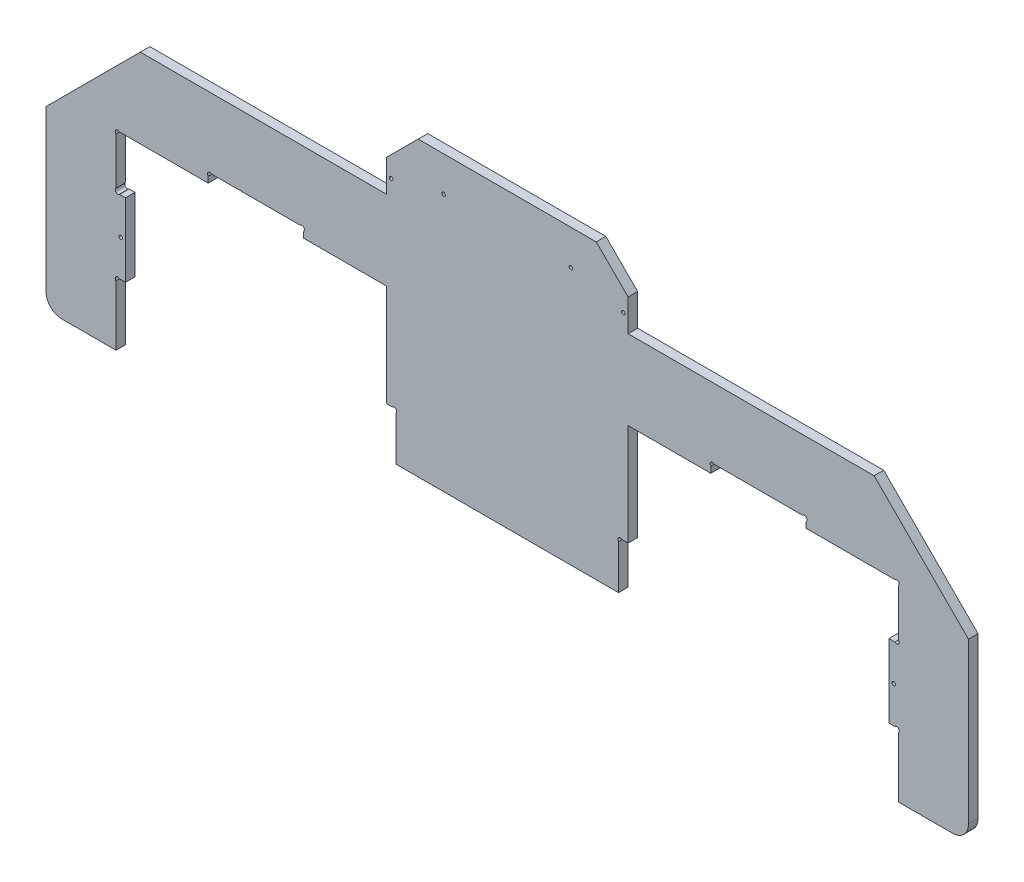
ISO-10303-21;
HEADER;
FILE_DESCRIPTION(('STEP AP214'),'2;1');
FILE_NAME('part.step','',(''),(''),'','','');
FILE_SCHEMA(('AUTOMOTIVE_DESIGN { 1 0 10303 214 1 1 1 1 }'));
ENDSEC;
DATA;
#1=APPLICATION_CONTEXT('core data for automotive mechanical design processes');
#2=APPLICATION_PROTOCOL_DEFINITION('international standard','automotive_design',2000,#1);
#3=PRODUCT_CONTEXT('',#1,'mechanical');
#4=PRODUCT('Part','Part','',(#3));
#5=PRODUCT_RELATED_PRODUCT_CATEGORY('part','',(#4));
#6=PRODUCT_DEFINITION_FORMATION('','',#4);
#7=PRODUCT_DEFINITION_CONTEXT('part definition',#1,'design');
#8=PRODUCT_DEFINITION('design','',#6,#7);
#9=PRODUCT_DEFINITION_SHAPE('','',#8);
#10=(LENGTH_UNIT() NAMED_UNIT(*) SI_UNIT(.MILLI.,.METRE.));
#11=(NAMED_UNIT(*) PLANE_ANGLE_UNIT() SI_UNIT($,.RADIAN.));
#12=(NAMED_UNIT(*) SI_UNIT($,.STERADIAN.) SOLID_ANGLE_UNIT());
#13=UNCERTAINTY_MEASURE_WITH_UNIT(LENGTH_MEASURE(1.E-05),#10,'distance_accuracy_value','');
#14=(GEOMETRIC_REPRESENTATION_CONTEXT(3) GLOBAL_UNCERTAINTY_ASSIGNED_CONTEXT((#13)) GLOBAL_UNIT_ASSIGNED_CONTEXT((#10,
#11,#12)) REPRESENTATION_CONTEXT('',''));
#15=CARTESIAN_POINT('',(0.,0.,0.));
#16=DIRECTION('',(0.,0.,1.));
#17=DIRECTION('',(1.,0.,0.));
#18=AXIS2_PLACEMENT_3D('',#15,#16,#17);
#19=CARTESIAN_POINT('',(280.,90.,6.));
#20=DIRECTION('',(0.,0.,1.));
#21=DIRECTION('',(1.,0.,0.));
#22=AXIS2_PLACEMENT_3D('',#19,#20,#21);
#23=PLANE('',#22);
#24=CARTESIAN_POINT('',(40.,268.,6.));
#25=DIRECTION('',(0.,0.,1.));
#26=DIRECTION('',(-1.,0.,0.));
#27=AXIS2_PLACEMENT_3D('',#24,#25,#26);
#28=CIRCLE('',#27,1.1);
#29=CARTESIAN_POINT('',(38.9,268.,6.));
#30=VERTEX_POINT('',#29);
#31=EDGE_CURVE('E845',#30,#30,#28,.T.);
#32=ORIENTED_EDGE('',*,*,#31,.F.);
#33=EDGE_LOOP('',(#32));
#34=FACE_BOUND('',#33,.T.);
#35=CARTESIAN_POINT('',(-40.,268.,6.));
#36=DIRECTION('',(0.,0.,1.));
#37=DIRECTION('',(1.,0.,0.));
#38=AXIS2_PLACEMENT_3D('',#35,#36,#37);
#39=CIRCLE('',#38,1.1);
#40=CARTESIAN_POINT('',(-38.9,268.,6.));
#41=VERTEX_POINT('',#40);
#42=EDGE_CURVE('E857',#41,#41,#39,.T.);
#43=ORIENTED_EDGE('',*,*,#42,.F.);
#44=EDGE_LOOP('',(#43));
#45=FACE_BOUND('',#44,.T.);
#46=CARTESIAN_POINT('',(243.,143.,6.));
#47=DIRECTION('',(0.,0.,1.));
#48=DIRECTION('',(1.,0.,0.));
#49=AXIS2_PLACEMENT_3D('',#46,#47,#48);
#50=CIRCLE('',#49,1.09999999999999);
#51=CARTESIAN_POINT('',(244.1,143.,6.));
#52=VERTEX_POINT('',#51);
#53=EDGE_CURVE('E410',#52,#52,#50,.T.);
#54=ORIENTED_EDGE('',*,*,#53,.F.);
#55=EDGE_LOOP('',(#54));
#56=FACE_BOUND('',#55,.T.);
#57=DIRECTION('',(-1.,0.,0.));
#58=VECTOR('',#57,1.);
#59=CARTESIAN_POINT('',(-56.,290.,6.));
#60=LINE('',#59,#58);
#61=CARTESIAN_POINT('',(56.,290.,6.));
#62=VERTEX_POINT('',#61);
#63=CARTESIAN_POINT('',(-56.,290.,6.));
#64=VERTEX_POINT('',#63);
#65=EDGE_CURVE('E513',#62,#64,#60,.T.);
#66=ORIENTED_EDGE('',*,*,#65,.T.);
#67=DIRECTION('',(-0.707106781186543,-0.707106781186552,0.));
#68=VECTOR('',#67,1.);
#69=CARTESIAN_POINT('',(-56.,290.,6.));
#70=LINE('',#69,#68);
#71=CARTESIAN_POINT('',(-76.,270.,6.));
#72=VERTEX_POINT('',#71);
#73=EDGE_CURVE('E231',#64,#72,#70,.T.);
#74=ORIENTED_EDGE('',*,*,#73,.T.);
#75=DIRECTION('',(0.,-1.,0.));
#76=VECTOR('',#75,1.);
#77=CARTESIAN_POINT('',(-76.,270.,6.));
#78=LINE('',#77,#76);
#79=CARTESIAN_POINT('',(-76.,250.,6.));
#80=VERTEX_POINT('',#79);
#81=EDGE_CURVE('E666',#72,#80,#78,.T.);
#82=ORIENTED_EDGE('',*,*,#81,.T.);
#83=DIRECTION('',(-1.,0.,0.));
#84=VECTOR('',#83,1.);
#85=CARTESIAN_POINT('',(-76.,250.,6.));
#86=LINE('',#85,#84);
#87=CARTESIAN_POINT('',(-230.710678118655,250.,6.));
#88=VERTEX_POINT('',#87);
#89=EDGE_CURVE('E685',#80,#88,#86,.T.);
#90=ORIENTED_EDGE('',*,*,#89,.T.);
#91=DIRECTION('',(-0.707106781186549,-0.707106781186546,0.));
#92=VECTOR('',#91,1.);
#93=CARTESIAN_POINT('',(-230.710678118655,250.,6.));
#94=LINE('',#93,#92);
#95=CARTESIAN_POINT('',(-290.,190.710678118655,6.));
#96=VERTEX_POINT('',#95);
#97=EDGE_CURVE('E682',#88,#96,#94,.T.);
#98=ORIENTED_EDGE('',*,*,#97,.T.);
#99=DIRECTION('',(0.,-1.,0.));
#100=VECTOR('',#99,1.);
#101=CARTESIAN_POINT('',(-290.,190.710678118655,6.));
#102=LINE('',#101,#100);
#103=CARTESIAN_POINT('',(-290.,90.0000000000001,6.));
#104=VERTEX_POINT('',#103);
#105=EDGE_CURVE('E684',#96,#104,#102,.T.);
#106=ORIENTED_EDGE('',*,*,#105,.T.);
#107=CARTESIAN_POINT('',(-280.,90.,6.));
#108=DIRECTION('',(0.,0.,1.));
#109=DIRECTION('',(-1.,0.,0.));
#110=AXIS2_PLACEMENT_3D('',#107,#108,#109);
#111=CIRCLE('',#110,10.);
#112=CARTESIAN_POINT('',(-280.,80.,6.));
#113=VERTEX_POINT('',#112);
#114=EDGE_CURVE('E687',#104,#113,#111,.T.);
#115=ORIENTED_EDGE('',*,*,#114,.T.);
#116=DIRECTION('',(1.,0.,0.));
#117=VECTOR('',#116,1.);
#118=CARTESIAN_POINT('',(-246.,80.,6.));
#119=LINE('',#118,#117);
#120=CARTESIAN_POINT('',(-246.,80.,6.));
#121=VERTEX_POINT('',#120);
#122=EDGE_CURVE('E693',#113,#121,#119,.T.);
#123=ORIENTED_EDGE('',*,*,#122,.T.);
#124=DIRECTION('',(0.,1.,0.));
#125=VECTOR('',#124,1.);
#126=CARTESIAN_POINT('',(-246.,117.737258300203,6.));
#127=LINE('',#126,#125);
#128=CARTESIAN_POINT('',(-246.,117.737258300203,6.));
#129=VERTEX_POINT('',#128);
#130=EDGE_CURVE('E695',#121,#129,#127,.T.);
#131=ORIENTED_EDGE('',*,*,#130,.T.);
#132=CARTESIAN_POINT('',(-244.868629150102,118.868629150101,6.));
#133=DIRECTION('',(0.,0.,-1.));
#134=DIRECTION('',(-1.,0.,0.));
#135=AXIS2_PLACEMENT_3D('',#132,#133,#134);
#136=CIRCLE('',#135,1.6);
#137=CARTESIAN_POINT('',(-243.737258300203,120.,6.));
#138=VERTEX_POINT('',#137);
#139=EDGE_CURVE('E697',#129,#138,#136,.T.);
#140=ORIENTED_EDGE('',*,*,#139,.T.);
#141=DIRECTION('',(1.,0.,0.));
#142=VECTOR('',#141,1.);
#143=CARTESIAN_POINT('',(-240.,120.,6.));
#144=LINE('',#143,#142);
#145=CARTESIAN_POINT('',(-240.,120.,6.));
#146=VERTEX_POINT('',#145);
#147=EDGE_CURVE('E699',#138,#146,#144,.T.);
#148=ORIENTED_EDGE('',*,*,#147,.T.);
#149=DIRECTION('',(0.,1.,0.));
#150=VECTOR('',#149,1.);
#151=CARTESIAN_POINT('',(-240.,166.,6.));
#152=LINE('',#151,#150);
#153=CARTESIAN_POINT('',(-240.,166.,6.));
#154=VERTEX_POINT('',#153);
#155=EDGE_CURVE('E701',#146,#154,#152,.T.);
#156=ORIENTED_EDGE('',*,*,#155,.T.);
#157=DIRECTION('',(-1.,0.,0.));
#158=VECTOR('',#157,1.);
#159=CARTESIAN_POINT('',(-243.737258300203,166.,6.));
#160=LINE('',#159,#158);
#161=CARTESIAN_POINT('',(-243.737258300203,166.,6.));
#162=VERTEX_POINT('',#161);
#163=EDGE_CURVE('E703',#154,#162,#160,.T.);
#164=ORIENTED_EDGE('',*,*,#163,.T.);
#165=CARTESIAN_POINT('',(-244.868629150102,167.131370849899,6.));
#166=DIRECTION('',(0.,0.,-1.));
#167=DIRECTION('',(1.,0.,0.));
#168=AXIS2_PLACEMENT_3D('',#165,#166,#167);
#169=CIRCLE('',#168,1.6);
#170=CARTESIAN_POINT('',(-246.,168.262741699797,6.));
#171=VERTEX_POINT('',#170);
#172=EDGE_CURVE('E705',#162,#171,#169,.T.);
#173=ORIENTED_EDGE('',*,*,#172,.T.);
#174=DIRECTION('',(0.,1.,0.));
#175=VECTOR('',#174,1.);
#176=CARTESIAN_POINT('',(-246.,197.737258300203,6.));
#177=LINE('',#176,#175);
#178=CARTESIAN_POINT('',(-246.,197.737258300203,6.));
#179=VERTEX_POINT('',#178);
#180=EDGE_CURVE('E707',#171,#179,#177,.T.);
#181=ORIENTED_EDGE('',*,*,#180,.T.);
#182=CARTESIAN_POINT('',(-244.868629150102,198.868629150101,6.));
#183=DIRECTION('',(0.,0.,-1.));
#184=DIRECTION('',(-1.,0.,0.));
#185=AXIS2_PLACEMENT_3D('',#182,#183,#184);
#186=CIRCLE('',#185,1.59999999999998);
#187=CARTESIAN_POINT('',(-243.737258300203,200.,6.));
#188=VERTEX_POINT('',#187);
#189=EDGE_CURVE('E709',#179,#188,#186,.T.);
#190=ORIENTED_EDGE('',*,*,#189,.T.);
#191=DIRECTION('',(1.,0.,0.));
#192=VECTOR('',#191,1.);
#193=CARTESIAN_POINT('',(-243.737258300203,200.,6.));
#194=LINE('',#193,#192);
#195=CARTESIAN_POINT('',(-188.,200.,6.));
#196=VERTEX_POINT('',#195);
#197=EDGE_CURVE('E711',#188,#196,#194,.T.);
#198=ORIENTED_EDGE('',*,*,#197,.T.);
#199=DIRECTION('',(-2.59935243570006E-13,1.,0.));
#200=VECTOR('',#199,1.);
#201=CARTESIAN_POINT('',(-188.000000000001,203.737258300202,6.));
#202=LINE('',#201,#200);
#203=CARTESIAN_POINT('',(-188.000000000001,203.737258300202,6.));
#204=VERTEX_POINT('',#203);
#205=EDGE_CURVE('E713',#196,#204,#202,.T.);
#206=ORIENTED_EDGE('',*,*,#205,.T.);
#207=CARTESIAN_POINT('',(-186.868629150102,204.8686291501,6.));
#208=DIRECTION('',(0.,0.,-1.));
#209=DIRECTION('',(1.,0.,0.));
#210=AXIS2_PLACEMENT_3D('',#207,#208,#209);
#211=CIRCLE('',#210,1.60000000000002);
#212=CARTESIAN_POINT('',(-185.737258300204,205.999999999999,6.));
#213=VERTEX_POINT('',#212);
#214=EDGE_CURVE('E715',#204,#213,#211,.T.);
#215=ORIENTED_EDGE('',*,*,#214,.T.);
#216=DIRECTION('',(1.,0.,0.));
#217=VECTOR('',#216,1.);
#218=CARTESIAN_POINT('',(-130.262741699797,206.,6.));
#219=LINE('',#218,#217);
#220=CARTESIAN_POINT('',(-130.262741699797,206.,6.));
#221=VERTEX_POINT('',#220);
#222=EDGE_CURVE('E717',#213,#221,#219,.T.);
#223=ORIENTED_EDGE('',*,*,#222,.T.);
#224=CARTESIAN_POINT('',(-129.131370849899,204.868629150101,6.));
#225=DIRECTION('',(0.,0.,-1.));
#226=DIRECTION('',(-1.,0.,0.));
#227=AXIS2_PLACEMENT_3D('',#224,#225,#226);
#228=CIRCLE('',#227,1.60000000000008);
#229=CARTESIAN_POINT('',(-128.,203.737258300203,6.));
#230=VERTEX_POINT('',#229);
#231=EDGE_CURVE('E719',#221,#230,#228,.T.);
#232=ORIENTED_EDGE('',*,*,#231,.T.);
#233=DIRECTION('',(0.,-1.,0.));
#234=VECTOR('',#233,1.);
#235=CARTESIAN_POINT('',(-128.,203.737258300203,6.));
#236=LINE('',#235,#234);
#237=CARTESIAN_POINT('',(-128.,200.,6.));
#238=VERTEX_POINT('',#237);
#239=EDGE_CURVE('E721',#230,#238,#236,.T.);
#240=ORIENTED_EDGE('',*,*,#239,.T.);
#241=DIRECTION('',(1.,0.,0.));
#242=VECTOR('',#241,1.);
#243=CARTESIAN_POINT('',(-128.,200.,6.));
#244=LINE('',#243,#242);
#245=CARTESIAN_POINT('',(-76.,200.,6.));
#246=VERTEX_POINT('',#245);
#247=EDGE_CURVE('E723',#238,#246,#244,.T.);
#248=ORIENTED_EDGE('',*,*,#247,.T.);
#249=DIRECTION('',(0.,-1.,0.));
#250=VECTOR('',#249,1.);
#251=CARTESIAN_POINT('',(-76.,136.,6.));
#252=LINE('',#251,#250);
#253=CARTESIAN_POINT('',(-76.,136.,6.));
#254=VERTEX_POINT('',#253);
#255=EDGE_CURVE('E725',#246,#254,#252,.T.);
#256=ORIENTED_EDGE('',*,*,#255,.T.);
#257=DIRECTION('',(1.,0.,0.));
#258=VECTOR('',#257,1.);
#259=CARTESIAN_POINT('',(-72.2627416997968,136.,6.));
#260=LINE('',#259,#258);
#261=CARTESIAN_POINT('',(-72.2627416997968,136.,6.));
#262=VERTEX_POINT('',#261);
#263=EDGE_CURVE('E727',#254,#262,#260,.T.);
#264=ORIENTED_EDGE('',*,*,#263,.T.);
#265=CARTESIAN_POINT('',(-71.1313708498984,134.868629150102,6.));
#266=DIRECTION('',(0.,0.,-1.));
#267=DIRECTION('',(-1.,0.,0.));
#268=AXIS2_PLACEMENT_3D('',#265,#266,#267);
#269=CIRCLE('',#268,1.59999999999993);
#270=CARTESIAN_POINT('',(-70.,133.737258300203,6.));
#271=VERTEX_POINT('',#270);
#272=EDGE_CURVE('E729',#262,#271,#269,.T.);
#273=ORIENTED_EDGE('',*,*,#272,.T.);
#274=DIRECTION('',(0.,-1.,0.));
#275=VECTOR('',#274,1.);
#276=CARTESIAN_POINT('',(-70.,133.737258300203,6.));
#277=LINE('',#276,#275);
#278=CARTESIAN_POINT('',(-70.,106.,6.));
#279=VERTEX_POINT('',#278);
#280=EDGE_CURVE('E731',#271,#279,#277,.T.);
#281=ORIENTED_EDGE('',*,*,#280,.T.);
#282=DIRECTION('',(1.,0.,0.));
#283=VECTOR('',#282,1.);
#284=CARTESIAN_POINT('',(-70.,106.,6.));
#285=LINE('',#284,#283);
#286=CARTESIAN_POINT('',(70.,106.,6.));
#287=VERTEX_POINT('',#286);
#288=EDGE_CURVE('E733',#279,#287,#285,.T.);
#289=ORIENTED_EDGE('',*,*,#288,.T.);
#290=DIRECTION('',(0.,1.,0.));
#291=VECTOR('',#290,1.);
#292=CARTESIAN_POINT('',(70.,133.737258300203,6.));
#293=LINE('',#292,#291);
#294=CARTESIAN_POINT('',(70.,133.737258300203,6.));
#295=VERTEX_POINT('',#294);
#296=EDGE_CURVE('E735',#287,#295,#293,.T.);
#297=ORIENTED_EDGE('',*,*,#296,.T.);
#298=CARTESIAN_POINT('',(71.1313708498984,134.868629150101,6.));
#299=DIRECTION('',(0.,0.,-1.));
#300=DIRECTION('',(1.,0.,0.));
#301=AXIS2_PLACEMENT_3D('',#298,#299,#300);
#302=CIRCLE('',#301,1.59999999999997);
#303=CARTESIAN_POINT('',(72.2627416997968,136.,6.));
#304=VERTEX_POINT('',#303);
#305=EDGE_CURVE('E737',#295,#304,#302,.T.);
#306=ORIENTED_EDGE('',*,*,#305,.T.);
#307=DIRECTION('',(1.,0.,0.));
#308=VECTOR('',#307,1.);
#309=CARTESIAN_POINT('',(72.2627416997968,136.,6.));
#310=LINE('',#309,#308);
#311=CARTESIAN_POINT('',(76.,136.,6.));
#312=VERTEX_POINT('',#311);
#313=EDGE_CURVE('E739',#304,#312,#310,.T.);
#314=ORIENTED_EDGE('',*,*,#313,.T.);
#315=DIRECTION('',(0.,1.,0.));
#316=VECTOR('',#315,1.);
#317=CARTESIAN_POINT('',(76.,136.,6.));
#318=LINE('',#317,#316);
#319=CARTESIAN_POINT('',(76.,200.,6.));
#320=VERTEX_POINT('',#319);
#321=EDGE_CURVE('E741',#312,#320,#318,.T.);
#322=ORIENTED_EDGE('',*,*,#321,.T.);
#323=DIRECTION('',(1.,0.,0.));
#324=VECTOR('',#323,1.);
#325=CARTESIAN_POINT('',(128.,200.,6.));
#326=LINE('',#325,#324);
#327=CARTESIAN_POINT('',(128.,200.,6.));
#328=VERTEX_POINT('',#327);
#329=EDGE_CURVE('E743',#320,#328,#326,.T.);
#330=ORIENTED_EDGE('',*,*,#329,.T.);
#331=DIRECTION('',(0.,1.,0.));
#332=VECTOR('',#331,1.);
#333=CARTESIAN_POINT('',(128.,203.737258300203,6.));
#334=LINE('',#333,#332);
#335=CARTESIAN_POINT('',(128.,203.737258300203,6.));
#336=VERTEX_POINT('',#335);
#337=EDGE_CURVE('E745',#328,#336,#334,.T.);
#338=ORIENTED_EDGE('',*,*,#337,.T.);
#339=CARTESIAN_POINT('',(129.131370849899,204.868629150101,6.));
#340=DIRECTION('',(0.,0.,-1.));
#341=DIRECTION('',(1.,0.,0.));
#342=AXIS2_PLACEMENT_3D('',#339,#340,#341);
#343=CIRCLE('',#342,1.60000000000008);
#344=CARTESIAN_POINT('',(130.262741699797,206.,6.));
#345=VERTEX_POINT('',#344);
#346=EDGE_CURVE('E747',#336,#345,#343,.T.);
#347=ORIENTED_EDGE('',*,*,#346,.T.);
#348=DIRECTION('',(1.,0.,0.));
#349=VECTOR('',#348,1.);
#350=CARTESIAN_POINT('',(130.262741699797,206.,6.));
#351=LINE('',#350,#349);
#352=CARTESIAN_POINT('',(185.737258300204,205.999999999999,6.));
#353=VERTEX_POINT('',#352);
#354=EDGE_CURVE('E749',#345,#353,#351,.T.);
#355=ORIENTED_EDGE('',*,*,#354,.T.);
#356=CARTESIAN_POINT('',(186.868629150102,204.8686291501,6.));
#357=DIRECTION('',(0.,0.,-1.));
#358=DIRECTION('',(-1.,0.,0.));
#359=AXIS2_PLACEMENT_3D('',#356,#357,#358);
#360=CIRCLE('',#359,1.60000000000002);
#361=CARTESIAN_POINT('',(188.000000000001,203.737258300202,6.));
#362=VERTEX_POINT('',#361);
#363=EDGE_CURVE('E751',#353,#362,#360,.T.);
#364=ORIENTED_EDGE('',*,*,#363,.T.);
#365=DIRECTION('',(-2.59935243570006E-13,-1.,0.));
#366=VECTOR('',#365,1.);
#367=CARTESIAN_POINT('',(188.000000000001,203.737258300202,6.));
#368=LINE('',#367,#366);
#369=CARTESIAN_POINT('',(188.,200.,6.));
#370=VERTEX_POINT('',#369);
#371=EDGE_CURVE('E753',#362,#370,#368,.T.);
#372=ORIENTED_EDGE('',*,*,#371,.T.);
#373=DIRECTION('',(1.,0.,0.));
#374=VECTOR('',#373,1.);
#375=CARTESIAN_POINT('',(243.737258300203,200.,6.));
#376=LINE('',#375,#374);
#377=CARTESIAN_POINT('',(243.737258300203,200.,6.));
#378=VERTEX_POINT('',#377);
#379=EDGE_CURVE('E755',#370,#378,#376,.T.);
#380=ORIENTED_EDGE('',*,*,#379,.T.);
#381=CARTESIAN_POINT('',(244.868629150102,198.868629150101,6.));
#382=DIRECTION('',(0.,0.,-1.));
#383=DIRECTION('',(1.,0.,0.));
#384=AXIS2_PLACEMENT_3D('',#381,#382,#383);
#385=CIRCLE('',#384,1.59999999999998);
#386=CARTESIAN_POINT('',(246.,197.737258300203,6.));
#387=VERTEX_POINT('',#386);
#388=EDGE_CURVE('E757',#378,#387,#385,.T.);
#389=ORIENTED_EDGE('',*,*,#388,.T.);
#390=DIRECTION('',(0.,-1.,0.));
#391=VECTOR('',#390,1.);
#392=CARTESIAN_POINT('',(246.,197.737258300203,6.));
#393=LINE('',#392,#391);
#394=CARTESIAN_POINT('',(246.,168.262741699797,6.));
#395=VERTEX_POINT('',#394);
#396=EDGE_CURVE('E759',#387,#395,#393,.T.);
#397=ORIENTED_EDGE('',*,*,#396,.T.);
#398=CARTESIAN_POINT('',(244.868629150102,167.131370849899,6.));
#399=DIRECTION('',(0.,0.,-1.));
#400=DIRECTION('',(-1.,0.,0.));
#401=AXIS2_PLACEMENT_3D('',#398,#399,#400);
#402=CIRCLE('',#401,1.6);
#403=CARTESIAN_POINT('',(243.737258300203,166.,6.));
#404=VERTEX_POINT('',#403);
#405=EDGE_CURVE('E761',#395,#404,#402,.T.);
#406=ORIENTED_EDGE('',*,*,#405,.T.);
#407=DIRECTION('',(-1.,0.,0.));
#408=VECTOR('',#407,1.);
#409=CARTESIAN_POINT('',(243.737258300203,166.,6.));
#410=LINE('',#409,#408);
#411=CARTESIAN_POINT('',(240.,166.,6.));
#412=VERTEX_POINT('',#411);
#413=EDGE_CURVE('E763',#404,#412,#410,.T.);
#414=ORIENTED_EDGE('',*,*,#413,.T.);
#415=DIRECTION('',(0.,-1.,0.));
#416=VECTOR('',#415,1.);
#417=CARTESIAN_POINT('',(240.,166.,6.));
#418=LINE('',#417,#416);
#419=CARTESIAN_POINT('',(240.,120.,6.));
#420=VERTEX_POINT('',#419);
#421=EDGE_CURVE('E765',#412,#420,#418,.T.);
#422=ORIENTED_EDGE('',*,*,#421,.T.);
#423=DIRECTION('',(1.,0.,0.));
#424=VECTOR('',#423,1.);
#425=CARTESIAN_POINT('',(240.,120.,6.));
#426=LINE('',#425,#424);
#427=CARTESIAN_POINT('',(243.737258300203,120.,6.));
#428=VERTEX_POINT('',#427);
#429=EDGE_CURVE('E767',#420,#428,#426,.T.);
#430=ORIENTED_EDGE('',*,*,#429,.T.);
#431=CARTESIAN_POINT('',(244.868629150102,118.868629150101,6.));
#432=DIRECTION('',(0.,0.,-1.));
#433=DIRECTION('',(1.,0.,0.));
#434=AXIS2_PLACEMENT_3D('',#431,#432,#433);
#435=CIRCLE('',#434,1.59999999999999);
#436=CARTESIAN_POINT('',(246.,117.737258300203,6.));
#437=VERTEX_POINT('',#436);
#438=EDGE_CURVE('E769',#428,#437,#435,.T.);
#439=ORIENTED_EDGE('',*,*,#438,.T.);
#440=DIRECTION('',(0.,-1.,0.));
#441=VECTOR('',#440,1.);
#442=CARTESIAN_POINT('',(246.,117.737258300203,6.));
#443=LINE('',#442,#441);
#444=CARTESIAN_POINT('',(246.,80.,6.));
#445=VERTEX_POINT('',#444);
#446=EDGE_CURVE('E771',#437,#445,#443,.T.);
#447=ORIENTED_EDGE('',*,*,#446,.T.);
#448=DIRECTION('',(1.,0.,0.));
#449=VECTOR('',#448,1.);
#450=CARTESIAN_POINT('',(246.,80.,6.));
#451=LINE('',#450,#449);
#452=CARTESIAN_POINT('',(280.,80.,6.));
#453=VERTEX_POINT('',#452);
#454=EDGE_CURVE('E773',#445,#453,#451,.T.);
#455=ORIENTED_EDGE('',*,*,#454,.T.);
#456=CARTESIAN_POINT('',(280.,90.,6.));
#457=DIRECTION('',(0.,0.,1.));
#458=DIRECTION('',(1.,0.,0.));
#459=AXIS2_PLACEMENT_3D('',#456,#457,#458);
#460=CIRCLE('',#459,10.);
#461=CARTESIAN_POINT('',(290.,90.0000000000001,6.));
#462=VERTEX_POINT('',#461);
#463=EDGE_CURVE('E775',#453,#462,#460,.T.);
#464=ORIENTED_EDGE('',*,*,#463,.T.);
#465=DIRECTION('',(0.,1.,0.));
#466=VECTOR('',#465,1.);
#467=CARTESIAN_POINT('',(290.,190.710678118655,6.));
#468=LINE('',#467,#466);
#469=CARTESIAN_POINT('',(290.,190.710678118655,6.));
#470=VERTEX_POINT('',#469);
#471=EDGE_CURVE('E777',#462,#470,#468,.T.);
#472=ORIENTED_EDGE('',*,*,#471,.T.);
#473=DIRECTION('',(-0.707106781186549,0.707106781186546,0.));
#474=VECTOR('',#473,1.);
#475=CARTESIAN_POINT('',(230.710678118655,250.,6.));
#476=LINE('',#475,#474);
#477=CARTESIAN_POINT('',(230.710678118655,250.,6.));
#478=VERTEX_POINT('',#477);
#479=EDGE_CURVE('E388',#470,#478,#476,.T.);
#480=ORIENTED_EDGE('',*,*,#479,.T.);
#481=DIRECTION('',(-1.,0.,0.));
#482=VECTOR('',#481,1.);
#483=CARTESIAN_POINT('',(76.,250.,6.));
#484=LINE('',#483,#482);
#485=CARTESIAN_POINT('',(76.,250.,6.));
#486=VERTEX_POINT('',#485);
#487=EDGE_CURVE('E382',#478,#486,#484,.T.);
#488=ORIENTED_EDGE('',*,*,#487,.T.);
#489=DIRECTION('',(0.,1.,0.));
#490=VECTOR('',#489,1.);
#491=CARTESIAN_POINT('',(76.,270.,6.));
#492=LINE('',#491,#490);
#493=CARTESIAN_POINT('',(76.,270.,6.));
#494=VERTEX_POINT('',#493);
#495=EDGE_CURVE('E386',#486,#494,#492,.T.);
#496=ORIENTED_EDGE('',*,*,#495,.T.);
#497=DIRECTION('',(-0.707106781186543,0.707106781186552,0.));
#498=VECTOR('',#497,1.);
#499=CARTESIAN_POINT('',(56.,290.,6.));
#500=LINE('',#499,#498);
#501=EDGE_CURVE('E50',#494,#62,#500,.T.);
#502=ORIENTED_EDGE('',*,*,#501,.T.);
#503=EDGE_LOOP('',(#66,#74,#82,#90,#98,#106,#115,#123,#131,#140,#148,#156,#164,#173,#181,#190,
#198,#206,#215,#223,#232,#240,#248,#256,#264,#273,#281,#289,#297,#306,#314,#322,#330,#338,#347,
#355,#364,#372,#380,#389,#397,#406,#414,#422,#430,#439,#447,#455,#464,#472,#480,#488,#496,#502));
#504=FACE_BOUND('',#503,.T.);
#505=CARTESIAN_POINT('',(-73.,260.,6.));
#506=DIRECTION('',(0.,0.,1.));
#507=DIRECTION('',(1.,0.,0.));
#508=AXIS2_PLACEMENT_3D('',#505,#506,#507);
#509=CIRCLE('',#508,1.1);
#510=CARTESIAN_POINT('',(-71.9,260.,6.));
#511=VERTEX_POINT('',#510);
#512=EDGE_CURVE('E863',#511,#511,#509,.T.);
#513=ORIENTED_EDGE('',*,*,#512,.F.);
#514=EDGE_LOOP('',(#513));
#515=FACE_BOUND('',#514,.T.);
#516=CARTESIAN_POINT('',(73.,260.,6.));
#517=DIRECTION('',(0.,0.,1.));
#518=DIRECTION('',(-1.,0.,0.));
#519=AXIS2_PLACEMENT_3D('',#516,#517,#518);
#520=CIRCLE('',#519,1.1);
#521=CARTESIAN_POINT('',(71.9,260.,6.));
#522=VERTEX_POINT('',#521);
#523=EDGE_CURVE('E851',#522,#522,#520,.T.);
#524=ORIENTED_EDGE('',*,*,#523,.F.);
#525=EDGE_LOOP('',(#524));
#526=FACE_BOUND('',#525,.T.);
#527=CARTESIAN_POINT('',(-243.,143.,6.));
#528=DIRECTION('',(0.,0.,1.));
#529=DIRECTION('',(-1.,0.,0.));
#530=AXIS2_PLACEMENT_3D('',#527,#528,#529);
#531=CIRCLE('',#530,1.09999999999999);
#532=CARTESIAN_POINT('',(-244.1,143.,6.));
#533=VERTEX_POINT('',#532);
#534=EDGE_CURVE('E836',#533,#533,#531,.T.);
#535=ORIENTED_EDGE('',*,*,#534,.F.);
#536=EDGE_LOOP('',(#535));
#537=FACE_BOUND('',#536,.T.);
#538=ADVANCED_FACE('F33',(#34,#45,#56,#504,#515,#526,#537),#23,.T.);
#539=CARTESIAN_POINT('',(280.,90.,0.));
#540=DIRECTION('',(0.,0.,1.));
#541=DIRECTION('',(1.,0.,0.));
#542=AXIS2_PLACEMENT_3D('',#539,#540,#541);
#543=PLANE('',#542);
#544=DIRECTION('',(-1.,0.,0.));
#545=VECTOR('',#544,1.);
#546=CARTESIAN_POINT('',(-56.,290.,0.));
#547=LINE('',#546,#545);
#548=CARTESIAN_POINT('',(56.,290.,0.));
#549=VERTEX_POINT('',#548);
#550=CARTESIAN_POINT('',(-56.,290.,0.));
#551=VERTEX_POINT('',#550);
#552=EDGE_CURVE('E406',#549,#551,#547,.T.);
#553=ORIENTED_EDGE('',*,*,#552,.F.);
#554=DIRECTION('',(-0.707106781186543,0.707106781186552,0.));
#555=VECTOR('',#554,1.);
#556=CARTESIAN_POINT('',(56.,290.,0.));
#557=LINE('',#556,#555);
#558=CARTESIAN_POINT('',(76.,270.,0.));
#559=VERTEX_POINT('',#558);
#560=EDGE_CURVE('E223',#559,#549,#557,.T.);
#561=ORIENTED_EDGE('',*,*,#560,.F.);
#562=DIRECTION('',(0.,1.,0.));
#563=VECTOR('',#562,1.);
#564=CARTESIAN_POINT('',(76.,270.,0.));
#565=LINE('',#564,#563);
#566=CARTESIAN_POINT('',(76.,250.,0.));
#567=VERTEX_POINT('',#566);
#568=EDGE_CURVE('E217',#567,#559,#565,.T.);
#569=ORIENTED_EDGE('',*,*,#568,.F.);
#570=DIRECTION('',(-1.,0.,0.));
#571=VECTOR('',#570,1.);
#572=CARTESIAN_POINT('',(76.,250.,0.));
#573=LINE('',#572,#571);
#574=CARTESIAN_POINT('',(230.710678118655,250.,0.));
#575=VERTEX_POINT('',#574);
#576=EDGE_CURVE('E396',#575,#567,#573,.T.);
#577=ORIENTED_EDGE('',*,*,#576,.F.);
#578=DIRECTION('',(-0.707106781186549,0.707106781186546,0.));
#579=VECTOR('',#578,1.);
#580=CARTESIAN_POINT('',(230.710678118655,250.,0.));
#581=LINE('',#580,#579);
#582=CARTESIAN_POINT('',(290.,190.710678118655,0.));
#583=VERTEX_POINT('',#582);
#584=EDGE_CURVE('E508',#583,#575,#581,.T.);
#585=ORIENTED_EDGE('',*,*,#584,.F.);
#586=DIRECTION('',(0.,1.,0.));
#587=VECTOR('',#586,1.);
#588=CARTESIAN_POINT('',(290.,190.710678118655,0.));
#589=LINE('',#588,#587);
#590=CARTESIAN_POINT('',(290.,90.0000000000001,0.));
#591=VERTEX_POINT('',#590);
#592=EDGE_CURVE('E506',#591,#583,#589,.T.);
#593=ORIENTED_EDGE('',*,*,#592,.F.);
#594=CARTESIAN_POINT('',(280.,90.,0.));
#595=DIRECTION('',(0.,0.,1.));
#596=DIRECTION('',(1.,0.,0.));
#597=AXIS2_PLACEMENT_3D('',#594,#595,#596);
#598=CIRCLE('',#597,10.);
#599=CARTESIAN_POINT('',(280.,80.,0.));
#600=VERTEX_POINT('',#599);
#601=EDGE_CURVE('E504',#600,#591,#598,.T.);
#602=ORIENTED_EDGE('',*,*,#601,.F.);
#603=DIRECTION('',(1.,0.,0.));
#604=VECTOR('',#603,1.);
#605=CARTESIAN_POINT('',(246.,80.,0.));
#606=LINE('',#605,#604);
#607=CARTESIAN_POINT('',(246.,80.,0.));
#608=VERTEX_POINT('',#607);
#609=EDGE_CURVE('E502',#608,#600,#606,.T.);
#610=ORIENTED_EDGE('',*,*,#609,.F.);
#611=DIRECTION('',(0.,-1.,0.));
#612=VECTOR('',#611,1.);
#613=CARTESIAN_POINT('',(246.,117.737258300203,0.));
#614=LINE('',#613,#612);
#615=CARTESIAN_POINT('',(246.,117.737258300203,0.));
#616=VERTEX_POINT('',#615);
#617=EDGE_CURVE('E500',#616,#608,#614,.T.);
#618=ORIENTED_EDGE('',*,*,#617,.F.);
#619=CARTESIAN_POINT('',(244.868629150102,118.868629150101,0.));
#620=DIRECTION('',(0.,0.,-1.));
#621=DIRECTION('',(1.,0.,0.));
#622=AXIS2_PLACEMENT_3D('',#619,#620,#621);
#623=CIRCLE('',#622,1.59999999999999);
#624=CARTESIAN_POINT('',(243.737258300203,120.,0.));
#625=VERTEX_POINT('',#624);
#626=EDGE_CURVE('E498',#625,#616,#623,.T.);
#627=ORIENTED_EDGE('',*,*,#626,.F.);
#628=DIRECTION('',(1.,0.,0.));
#629=VECTOR('',#628,1.);
#630=CARTESIAN_POINT('',(240.,120.,0.));
#631=LINE('',#630,#629);
#632=CARTESIAN_POINT('',(240.,120.,0.));
#633=VERTEX_POINT('',#632);
#634=EDGE_CURVE('E496',#633,#625,#631,.T.);
#635=ORIENTED_EDGE('',*,*,#634,.F.);
#636=DIRECTION('',(0.,-1.,0.));
#637=VECTOR('',#636,1.);
#638=CARTESIAN_POINT('',(240.,166.,0.));
#639=LINE('',#638,#637);
#640=CARTESIAN_POINT('',(240.,166.,0.));
#641=VERTEX_POINT('',#640);
#642=EDGE_CURVE('E494',#641,#633,#639,.T.);
#643=ORIENTED_EDGE('',*,*,#642,.F.);
#644=DIRECTION('',(-1.,0.,0.));
#645=VECTOR('',#644,1.);
#646=CARTESIAN_POINT('',(243.737258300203,166.,0.));
#647=LINE('',#646,#645);
#648=CARTESIAN_POINT('',(243.737258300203,166.,0.));
#649=VERTEX_POINT('',#648);
#650=EDGE_CURVE('E492',#649,#641,#647,.T.);
#651=ORIENTED_EDGE('',*,*,#650,.F.);
#652=CARTESIAN_POINT('',(244.868629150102,167.131370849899,0.));
#653=DIRECTION('',(0.,0.,-1.));
#654=DIRECTION('',(-1.,0.,0.));
#655=AXIS2_PLACEMENT_3D('',#652,#653,#654);
#656=CIRCLE('',#655,1.6);
#657=CARTESIAN_POINT('',(246.,168.262741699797,0.));
#658=VERTEX_POINT('',#657);
#659=EDGE_CURVE('E490',#658,#649,#656,.T.);
#660=ORIENTED_EDGE('',*,*,#659,.F.);
#661=DIRECTION('',(0.,-1.,0.));
#662=VECTOR('',#661,1.);
#663=CARTESIAN_POINT('',(246.,197.737258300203,0.));
#664=LINE('',#663,#662);
#665=CARTESIAN_POINT('',(246.,197.737258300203,0.));
#666=VERTEX_POINT('',#665);
#667=EDGE_CURVE('E488',#666,#658,#664,.T.);
#668=ORIENTED_EDGE('',*,*,#667,.F.);
#669=CARTESIAN_POINT('',(244.868629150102,198.868629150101,0.));
#670=DIRECTION('',(0.,0.,-1.));
#671=DIRECTION('',(1.,0.,0.));
#672=AXIS2_PLACEMENT_3D('',#669,#670,#671);
#673=CIRCLE('',#672,1.59999999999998);
#674=CARTESIAN_POINT('',(243.737258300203,200.,0.));
#675=VERTEX_POINT('',#674);
#676=EDGE_CURVE('E486',#675,#666,#673,.T.);
#677=ORIENTED_EDGE('',*,*,#676,.F.);
#678=DIRECTION('',(1.,0.,0.));
#679=VECTOR('',#678,1.);
#680=CARTESIAN_POINT('',(243.737258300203,200.,0.));
#681=LINE('',#680,#679);
#682=CARTESIAN_POINT('',(188.,200.,0.));
#683=VERTEX_POINT('',#682);
#684=EDGE_CURVE('E484',#683,#675,#681,.T.);
#685=ORIENTED_EDGE('',*,*,#684,.F.);
#686=DIRECTION('',(-2.59935243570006E-13,-1.,0.));
#687=VECTOR('',#686,1.);
#688=CARTESIAN_POINT('',(188.000000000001,203.737258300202,0.));
#689=LINE('',#688,#687);
#690=CARTESIAN_POINT('',(188.000000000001,203.737258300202,0.));
#691=VERTEX_POINT('',#690);
#692=EDGE_CURVE('E482',#691,#683,#689,.T.);
#693=ORIENTED_EDGE('',*,*,#692,.F.);
#694=CARTESIAN_POINT('',(186.868629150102,204.8686291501,0.));
#695=DIRECTION('',(0.,0.,-1.));
#696=DIRECTION('',(-1.,0.,0.));
#697=AXIS2_PLACEMENT_3D('',#694,#695,#696);
#698=CIRCLE('',#697,1.60000000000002);
#699=CARTESIAN_POINT('',(185.737258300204,205.999999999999,0.));
#700=VERTEX_POINT('',#699);
#701=EDGE_CURVE('E480',#700,#691,#698,.T.);
#702=ORIENTED_EDGE('',*,*,#701,.F.);
#703=DIRECTION('',(1.,0.,0.));
#704=VECTOR('',#703,1.);
#705=CARTESIAN_POINT('',(130.262741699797,206.,0.));
#706=LINE('',#705,#704);
#707=CARTESIAN_POINT('',(130.262741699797,206.,0.));
#708=VERTEX_POINT('',#707);
#709=EDGE_CURVE('E478',#708,#700,#706,.T.);
#710=ORIENTED_EDGE('',*,*,#709,.F.);
#711=CARTESIAN_POINT('',(129.131370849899,204.868629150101,0.));
#712=DIRECTION('',(0.,0.,-1.));
#713=DIRECTION('',(1.,0.,0.));
#714=AXIS2_PLACEMENT_3D('',#711,#712,#713);
#715=CIRCLE('',#714,1.60000000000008);
#716=CARTESIAN_POINT('',(128.,203.737258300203,0.));
#717=VERTEX_POINT('',#716);
#718=EDGE_CURVE('E476',#717,#708,#715,.T.);
#719=ORIENTED_EDGE('',*,*,#718,.F.);
#720=DIRECTION('',(0.,1.,0.));
#721=VECTOR('',#720,1.);
#722=CARTESIAN_POINT('',(128.,203.737258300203,0.));
#723=LINE('',#722,#721);
#724=CARTESIAN_POINT('',(128.,200.,0.));
#725=VERTEX_POINT('',#724);
#726=EDGE_CURVE('E474',#725,#717,#723,.T.);
#727=ORIENTED_EDGE('',*,*,#726,.F.);
#728=DIRECTION('',(1.,0.,0.));
#729=VECTOR('',#728,1.);
#730=CARTESIAN_POINT('',(128.,200.,0.));
#731=LINE('',#730,#729);
#732=CARTESIAN_POINT('',(76.,200.,0.));
#733=VERTEX_POINT('',#732);
#734=EDGE_CURVE('E472',#733,#725,#731,.T.);
#735=ORIENTED_EDGE('',*,*,#734,.F.);
#736=DIRECTION('',(0.,1.,0.));
#737=VECTOR('',#736,1.);
#738=CARTESIAN_POINT('',(76.,136.,0.));
#739=LINE('',#738,#737);
#740=CARTESIAN_POINT('',(76.,136.,0.));
#741=VERTEX_POINT('',#740);
#742=EDGE_CURVE('E470',#741,#733,#739,.T.);
#743=ORIENTED_EDGE('',*,*,#742,.F.);
#744=DIRECTION('',(1.,0.,0.));
#745=VECTOR('',#744,1.);
#746=CARTESIAN_POINT('',(72.2627416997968,136.,0.));
#747=LINE('',#746,#745);
#748=CARTESIAN_POINT('',(72.2627416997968,136.,0.));
#749=VERTEX_POINT('',#748);
#750=EDGE_CURVE('E468',#749,#741,#747,.T.);
#751=ORIENTED_EDGE('',*,*,#750,.F.);
#752=CARTESIAN_POINT('',(71.1313708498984,134.868629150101,0.));
#753=DIRECTION('',(0.,0.,-1.));
#754=DIRECTION('',(1.,0.,0.));
#755=AXIS2_PLACEMENT_3D('',#752,#753,#754);
#756=CIRCLE('',#755,1.59999999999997);
#757=CARTESIAN_POINT('',(70.,133.737258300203,0.));
#758=VERTEX_POINT('',#757);
#759=EDGE_CURVE('E466',#758,#749,#756,.T.);
#760=ORIENTED_EDGE('',*,*,#759,.F.);
#761=DIRECTION('',(0.,1.,0.));
#762=VECTOR('',#761,1.);
#763=CARTESIAN_POINT('',(70.,133.737258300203,0.));
#764=LINE('',#763,#762);
#765=CARTESIAN_POINT('',(70.,106.,0.));
#766=VERTEX_POINT('',#765);
#767=EDGE_CURVE('E464',#766,#758,#764,.T.);
#768=ORIENTED_EDGE('',*,*,#767,.F.);
#769=DIRECTION('',(1.,0.,0.));
#770=VECTOR('',#769,1.);
#771=CARTESIAN_POINT('',(-70.,106.,0.));
#772=LINE('',#771,#770);
#773=CARTESIAN_POINT('',(-70.,106.,0.));
#774=VERTEX_POINT('',#773);
#775=EDGE_CURVE('E462',#774,#766,#772,.T.);
#776=ORIENTED_EDGE('',*,*,#775,.F.);
#777=DIRECTION('',(0.,-1.,0.));
#778=VECTOR('',#777,1.);
#779=CARTESIAN_POINT('',(-70.,133.737258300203,0.));
#780=LINE('',#779,#778);
#781=CARTESIAN_POINT('',(-70.,133.737258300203,0.));
#782=VERTEX_POINT('',#781);
#783=EDGE_CURVE('E460',#782,#774,#780,.T.);
#784=ORIENTED_EDGE('',*,*,#783,.F.);
#785=CARTESIAN_POINT('',(-71.1313708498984,134.868629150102,0.));
#786=DIRECTION('',(0.,0.,-1.));
#787=DIRECTION('',(-1.,0.,0.));
#788=AXIS2_PLACEMENT_3D('',#785,#786,#787);
#789=CIRCLE('',#788,1.59999999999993);
#790=CARTESIAN_POINT('',(-72.2627416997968,136.,0.));
#791=VERTEX_POINT('',#790);
#792=EDGE_CURVE('E458',#791,#782,#789,.T.);
#793=ORIENTED_EDGE('',*,*,#792,.F.);
#794=DIRECTION('',(1.,0.,0.));
#795=VECTOR('',#794,1.);
#796=CARTESIAN_POINT('',(-72.2627416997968,136.,0.));
#797=LINE('',#796,#795);
#798=CARTESIAN_POINT('',(-76.,136.,0.));
#799=VERTEX_POINT('',#798);
#800=EDGE_CURVE('E456',#799,#791,#797,.T.);
#801=ORIENTED_EDGE('',*,*,#800,.F.);
#802=DIRECTION('',(0.,-1.,0.));
#803=VECTOR('',#802,1.);
#804=CARTESIAN_POINT('',(-76.,136.,0.));
#805=LINE('',#804,#803);
#806=CARTESIAN_POINT('',(-76.,200.,0.));
#807=VERTEX_POINT('',#806);
#808=EDGE_CURVE('E454',#807,#799,#805,.T.);
#809=ORIENTED_EDGE('',*,*,#808,.F.);
#810=DIRECTION('',(1.,0.,0.));
#811=VECTOR('',#810,1.);
#812=CARTESIAN_POINT('',(-128.,200.,0.));
#813=LINE('',#812,#811);
#814=CARTESIAN_POINT('',(-128.,200.,0.));
#815=VERTEX_POINT('',#814);
#816=EDGE_CURVE('E452',#815,#807,#813,.T.);
#817=ORIENTED_EDGE('',*,*,#816,.F.);
#818=DIRECTION('',(0.,-1.,0.));
#819=VECTOR('',#818,1.);
#820=CARTESIAN_POINT('',(-128.,203.737258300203,0.));
#821=LINE('',#820,#819);
#822=CARTESIAN_POINT('',(-128.,203.737258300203,0.));
#823=VERTEX_POINT('',#822);
#824=EDGE_CURVE('E450',#823,#815,#821,.T.);
#825=ORIENTED_EDGE('',*,*,#824,.F.);
#826=CARTESIAN_POINT('',(-129.131370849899,204.868629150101,0.));
#827=DIRECTION('',(0.,0.,-1.));
#828=DIRECTION('',(-1.,0.,0.));
#829=AXIS2_PLACEMENT_3D('',#826,#827,#828);
#830=CIRCLE('',#829,1.60000000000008);
#831=CARTESIAN_POINT('',(-130.262741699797,206.,0.));
#832=VERTEX_POINT('',#831);
#833=EDGE_CURVE('E448',#832,#823,#830,.T.);
#834=ORIENTED_EDGE('',*,*,#833,.F.);
#835=DIRECTION('',(1.,0.,0.));
#836=VECTOR('',#835,1.);
#837=CARTESIAN_POINT('',(-130.262741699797,206.,0.));
#838=LINE('',#837,#836);
#839=CARTESIAN_POINT('',(-185.737258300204,205.999999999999,0.));
#840=VERTEX_POINT('',#839);
#841=EDGE_CURVE('E446',#840,#832,#838,.T.);
#842=ORIENTED_EDGE('',*,*,#841,.F.);
#843=CARTESIAN_POINT('',(-186.868629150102,204.8686291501,0.));
#844=DIRECTION('',(0.,0.,-1.));
#845=DIRECTION('',(1.,0.,0.));
#846=AXIS2_PLACEMENT_3D('',#843,#844,#845);
#847=CIRCLE('',#846,1.60000000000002);
#848=CARTESIAN_POINT('',(-188.000000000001,203.737258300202,0.));
#849=VERTEX_POINT('',#848);
#850=EDGE_CURVE('E444',#849,#840,#847,.T.);
#851=ORIENTED_EDGE('',*,*,#850,.F.);
#852=DIRECTION('',(-2.59935243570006E-13,1.,0.));
#853=VECTOR('',#852,1.);
#854=CARTESIAN_POINT('',(-188.000000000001,203.737258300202,0.));
#855=LINE('',#854,#853);
#856=CARTESIAN_POINT('',(-188.,200.,0.));
#857=VERTEX_POINT('',#856);
#858=EDGE_CURVE('E442',#857,#849,#855,.T.);
#859=ORIENTED_EDGE('',*,*,#858,.F.);
#860=DIRECTION('',(1.,0.,0.));
#861=VECTOR('',#860,1.);
#862=CARTESIAN_POINT('',(-243.737258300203,200.,0.));
#863=LINE('',#862,#861);
#864=CARTESIAN_POINT('',(-243.737258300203,200.,0.));
#865=VERTEX_POINT('',#864);
#866=EDGE_CURVE('E440',#865,#857,#863,.T.);
#867=ORIENTED_EDGE('',*,*,#866,.F.);
#868=CARTESIAN_POINT('',(-244.868629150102,198.868629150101,0.));
#869=DIRECTION('',(0.,0.,-1.));
#870=DIRECTION('',(-1.,0.,0.));
#871=AXIS2_PLACEMENT_3D('',#868,#869,#870);
#872=CIRCLE('',#871,1.59999999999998);
#873=CARTESIAN_POINT('',(-246.,197.737258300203,0.));
#874=VERTEX_POINT('',#873);
#875=EDGE_CURVE('E438',#874,#865,#872,.T.);
#876=ORIENTED_EDGE('',*,*,#875,.F.);
#877=DIRECTION('',(0.,1.,0.));
#878=VECTOR('',#877,1.);
#879=CARTESIAN_POINT('',(-246.,197.737258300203,0.));
#880=LINE('',#879,#878);
#881=CARTESIAN_POINT('',(-246.,168.262741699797,0.));
#882=VERTEX_POINT('',#881);
#883=EDGE_CURVE('E436',#882,#874,#880,.T.);
#884=ORIENTED_EDGE('',*,*,#883,.F.);
#885=CARTESIAN_POINT('',(-244.868629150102,167.131370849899,0.));
#886=DIRECTION('',(0.,0.,-1.));
#887=DIRECTION('',(1.,0.,0.));
#888=AXIS2_PLACEMENT_3D('',#885,#886,#887);
#889=CIRCLE('',#888,1.6);
#890=CARTESIAN_POINT('',(-243.737258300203,166.,0.));
#891=VERTEX_POINT('',#890);
#892=EDGE_CURVE('E434',#891,#882,#889,.T.);
#893=ORIENTED_EDGE('',*,*,#892,.F.);
#894=DIRECTION('',(-1.,0.,0.));
#895=VECTOR('',#894,1.);
#896=CARTESIAN_POINT('',(-243.737258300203,166.,0.));
#897=LINE('',#896,#895);
#898=CARTESIAN_POINT('',(-240.,166.,0.));
#899=VERTEX_POINT('',#898);
#900=EDGE_CURVE('E432',#899,#891,#897,.T.);
#901=ORIENTED_EDGE('',*,*,#900,.F.);
#902=DIRECTION('',(0.,1.,0.));
#903=VECTOR('',#902,1.);
#904=CARTESIAN_POINT('',(-240.,166.,0.));
#905=LINE('',#904,#903);
#906=CARTESIAN_POINT('',(-240.,120.,0.));
#907=VERTEX_POINT('',#906);
#908=EDGE_CURVE('E430',#907,#899,#905,.T.);
#909=ORIENTED_EDGE('',*,*,#908,.F.);
#910=DIRECTION('',(1.,0.,0.));
#911=VECTOR('',#910,1.);
#912=CARTESIAN_POINT('',(-240.,120.,0.));
#913=LINE('',#912,#911);
#914=CARTESIAN_POINT('',(-243.737258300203,120.,0.));
#915=VERTEX_POINT('',#914);
#916=EDGE_CURVE('E428',#915,#907,#913,.T.);
#917=ORIENTED_EDGE('',*,*,#916,.F.);
#918=CARTESIAN_POINT('',(-244.868629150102,118.868629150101,0.));
#919=DIRECTION('',(0.,0.,-1.));
#920=DIRECTION('',(-1.,0.,0.));
#921=AXIS2_PLACEMENT_3D('',#918,#919,#920);
#922=CIRCLE('',#921,1.6);
#923=CARTESIAN_POINT('',(-246.,117.737258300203,0.));
#924=VERTEX_POINT('',#923);
#925=EDGE_CURVE('E426',#924,#915,#922,.T.);
#926=ORIENTED_EDGE('',*,*,#925,.F.);
#927=DIRECTION('',(0.,1.,0.));
#928=VECTOR('',#927,1.);
#929=CARTESIAN_POINT('',(-246.,117.737258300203,0.));
#930=LINE('',#929,#928);
#931=CARTESIAN_POINT('',(-246.,80.,0.));
#932=VERTEX_POINT('',#931);
#933=EDGE_CURVE('E424',#932,#924,#930,.T.);
#934=ORIENTED_EDGE('',*,*,#933,.F.);
#935=DIRECTION('',(1.,0.,0.));
#936=VECTOR('',#935,1.);
#937=CARTESIAN_POINT('',(-246.,80.,0.));
#938=LINE('',#937,#936);
#939=CARTESIAN_POINT('',(-280.,80.,0.));
#940=VERTEX_POINT('',#939);
#941=EDGE_CURVE('E422',#940,#932,#938,.T.);
#942=ORIENTED_EDGE('',*,*,#941,.F.);
#943=CARTESIAN_POINT('',(-280.,90.,0.));
#944=DIRECTION('',(0.,0.,1.));
#945=DIRECTION('',(-1.,0.,0.));
#946=AXIS2_PLACEMENT_3D('',#943,#944,#945);
#947=CIRCLE('',#946,10.);
#948=CARTESIAN_POINT('',(-290.,90.0000000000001,0.));
#949=VERTEX_POINT('',#948);
#950=EDGE_CURVE('E420',#949,#940,#947,.T.);
#951=ORIENTED_EDGE('',*,*,#950,.F.);
#952=DIRECTION('',(0.,-1.,0.));
#953=VECTOR('',#952,1.);
#954=CARTESIAN_POINT('',(-290.,190.710678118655,0.));
#955=LINE('',#954,#953);
#956=CARTESIAN_POINT('',(-290.,190.710678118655,0.));
#957=VERTEX_POINT('',#956);
#958=EDGE_CURVE('E418',#957,#949,#955,.T.);
#959=ORIENTED_EDGE('',*,*,#958,.F.);
#960=DIRECTION('',(-0.707106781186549,-0.707106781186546,0.));
#961=VECTOR('',#960,1.);
#962=CARTESIAN_POINT('',(-230.710678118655,250.,0.));
#963=LINE('',#962,#961);
#964=CARTESIAN_POINT('',(-230.710678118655,250.,0.));
#965=VERTEX_POINT('',#964);
#966=EDGE_CURVE('E416',#965,#957,#963,.T.);
#967=ORIENTED_EDGE('',*,*,#966,.F.);
#968=DIRECTION('',(-1.,0.,0.));
#969=VECTOR('',#968,1.);
#970=CARTESIAN_POINT('',(-76.,250.,0.));
#971=LINE('',#970,#969);
#972=CARTESIAN_POINT('',(-76.,250.,0.));
#973=VERTEX_POINT('',#972);
#974=EDGE_CURVE('E414',#973,#965,#971,.T.);
#975=ORIENTED_EDGE('',*,*,#974,.F.);
#976=DIRECTION('',(0.,-1.,0.));
#977=VECTOR('',#976,1.);
#978=CARTESIAN_POINT('',(-76.,270.,0.));
#979=LINE('',#978,#977);
#980=CARTESIAN_POINT('',(-76.,270.,0.));
#981=VERTEX_POINT('',#980);
#982=EDGE_CURVE('E412',#981,#973,#979,.T.);
#983=ORIENTED_EDGE('',*,*,#982,.F.);
#984=DIRECTION('',(-0.707106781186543,-0.707106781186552,0.));
#985=VECTOR('',#984,1.);
#986=CARTESIAN_POINT('',(-56.,290.,0.));
#987=LINE('',#986,#985);
#988=EDGE_CURVE('E409',#551,#981,#987,.T.);
#989=ORIENTED_EDGE('',*,*,#988,.F.);
#990=EDGE_LOOP('',(#553,#561,#569,#577,#585,#593,#602,#610,#618,#627,#635,#643,#651,#660,#668,
#677,#685,#693,#702,#710,#719,#727,#735,#743,#751,#760,#768,#776,#784,#793,#801,#809,#817,#825,
#834,#842,#851,#859,#867,#876,#884,#893,#901,#909,#917,#926,#934,#942,#951,#959,#967,#975,#983,#989));
#991=FACE_BOUND('',#990,.T.);
#992=CARTESIAN_POINT('',(243.,143.,0.));
#993=DIRECTION('',(0.,0.,1.));
#994=DIRECTION('',(1.,0.,0.));
#995=AXIS2_PLACEMENT_3D('',#992,#993,#994);
#996=CIRCLE('',#995,1.09999999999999);
#997=CARTESIAN_POINT('',(244.1,143.,0.));
#998=VERTEX_POINT('',#997);
#999=EDGE_CURVE('E866',#998,#998,#996,.T.);
#1000=ORIENTED_EDGE('',*,*,#999,.T.);
#1001=EDGE_LOOP('',(#1000));
#1002=FACE_BOUND('',#1001,.T.);
#1003=CARTESIAN_POINT('',(-73.,260.,0.));
#1004=DIRECTION('',(0.,0.,1.));
#1005=DIRECTION('',(1.,0.,0.));
#1006=AXIS2_PLACEMENT_3D('',#1003,#1004,#1005);
#1007=CIRCLE('',#1006,1.1);
#1008=CARTESIAN_POINT('',(-71.9,260.,0.));
#1009=VERTEX_POINT('',#1008);
#1010=EDGE_CURVE('E860',#1009,#1009,#1007,.T.);
#1011=ORIENTED_EDGE('',*,*,#1010,.T.);
#1012=EDGE_LOOP('',(#1011));
#1013=FACE_BOUND('',#1012,.T.);
#1014=CARTESIAN_POINT('',(-40.,268.,0.));
#1015=DIRECTION('',(0.,0.,1.));
#1016=DIRECTION('',(1.,0.,0.));
#1017=AXIS2_PLACEMENT_3D('',#1014,#1015,#1016);
#1018=CIRCLE('',#1017,1.1);
#1019=CARTESIAN_POINT('',(-38.9,268.,0.));
#1020=VERTEX_POINT('',#1019);
#1021=EDGE_CURVE('E854',#1020,#1020,#1018,.T.);
#1022=ORIENTED_EDGE('',*,*,#1021,.T.);
#1023=EDGE_LOOP('',(#1022));
#1024=FACE_BOUND('',#1023,.T.);
#1025=CARTESIAN_POINT('',(73.,260.,0.));
#1026=DIRECTION('',(0.,0.,1.));
#1027=DIRECTION('',(-1.,0.,0.));
#1028=AXIS2_PLACEMENT_3D('',#1025,#1026,#1027);
#1029=CIRCLE('',#1028,1.1);
#1030=CARTESIAN_POINT('',(71.9,260.,0.));
#1031=VERTEX_POINT('',#1030);
#1032=EDGE_CURVE('E848',#1031,#1031,#1029,.T.);
#1033=ORIENTED_EDGE('',*,*,#1032,.T.);
#1034=EDGE_LOOP('',(#1033));
#1035=FACE_BOUND('',#1034,.T.);
#1036=CARTESIAN_POINT('',(40.,268.,0.));
#1037=DIRECTION('',(0.,0.,1.));
#1038=DIRECTION('',(-1.,0.,0.));
#1039=AXIS2_PLACEMENT_3D('',#1036,#1037,#1038);
#1040=CIRCLE('',#1039,1.1);
#1041=CARTESIAN_POINT('',(38.9,268.,0.));
#1042=VERTEX_POINT('',#1041);
#1043=EDGE_CURVE('E842',#1042,#1042,#1040,.T.);
#1044=ORIENTED_EDGE('',*,*,#1043,.T.);
#1045=EDGE_LOOP('',(#1044));
#1046=FACE_BOUND('',#1045,.T.);
#1047=CARTESIAN_POINT('',(-243.,143.,0.));
#1048=DIRECTION('',(0.,0.,1.));
#1049=DIRECTION('',(-1.,0.,0.));
#1050=AXIS2_PLACEMENT_3D('',#1047,#1048,#1049);
#1051=CIRCLE('',#1050,1.09999999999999);
#1052=CARTESIAN_POINT('',(-244.1,143.,0.));
#1053=VERTEX_POINT('',#1052);
#1054=EDGE_CURVE('E839',#1053,#1053,#1051,.T.);
#1055=ORIENTED_EDGE('',*,*,#1054,.T.);
#1056=EDGE_LOOP('',(#1055));
#1057=FACE_BOUND('',#1056,.T.);
#1058=ADVANCED_FACE('F670',(#991,#1002,#1013,#1024,#1035,#1046,#1057),#543,.F.);
#1059=CARTESIAN_POINT('',(-56.,290.,6.));
#1060=DIRECTION('',(0.,-1.,0.));
#1061=DIRECTION('',(0.,0.,-1.));
#1062=AXIS2_PLACEMENT_3D('',#1059,#1060,#1061);
#1063=PLANE('',#1062);
#1064=ORIENTED_EDGE('',*,*,#552,.T.);
#1065=DIRECTION('',(0.,0.,-1.));
#1066=VECTOR('',#1065,1.);
#1067=CARTESIAN_POINT('',(-56.,290.,6.));
#1068=LINE('',#1067,#1066);
#1069=EDGE_CURVE('E11',#64,#551,#1068,.T.);
#1070=ORIENTED_EDGE('',*,*,#1069,.F.);
#1071=ORIENTED_EDGE('',*,*,#65,.F.);
#1072=DIRECTION('',(0.,0.,-1.));
#1073=VECTOR('',#1072,1.);
#1074=CARTESIAN_POINT('',(56.,290.,6.));
#1075=LINE('',#1074,#1073);
#1076=EDGE_CURVE('E402',#62,#549,#1075,.T.);
#1077=ORIENTED_EDGE('',*,*,#1076,.T.);
#1078=EDGE_LOOP('',(#1064,#1070,#1071,#1077));
#1079=FACE_BOUND('',#1078,.T.);
#1080=ADVANCED_FACE('F35',(#1079),#1063,.F.);
#1081=CARTESIAN_POINT('',(-56.,290.,6.));
#1082=DIRECTION('',(0.707106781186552,-0.707106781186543,0.));
#1083=DIRECTION('',(0.707106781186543,0.707106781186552,0.));
#1084=AXIS2_PLACEMENT_3D('',#1081,#1082,#1083);
#1085=PLANE('',#1084);
#1086=ORIENTED_EDGE('',*,*,#988,.T.);
#1087=DIRECTION('',(0.,0.,-1.));
#1088=VECTOR('',#1087,1.);
#1089=CARTESIAN_POINT('',(-76.,270.,6.));
#1090=LINE('',#1089,#1088);
#1091=EDGE_CURVE('E42',#72,#981,#1090,.T.);
#1092=ORIENTED_EDGE('',*,*,#1091,.F.);
#1093=ORIENTED_EDGE('',*,*,#73,.F.);
#1094=ORIENTED_EDGE('',*,*,#1069,.T.);
#1095=EDGE_LOOP('',(#1086,#1092,#1093,#1094));
#1096=FACE_BOUND('',#1095,.T.);
#1097=ADVANCED_FACE('F1414',(#1096),#1085,.F.);
#1098=CARTESIAN_POINT('',(-76.,270.,6.));
#1099=DIRECTION('',(1.,0.,0.));
#1100=DIRECTION('',(0.,1.,0.));
#1101=AXIS2_PLACEMENT_3D('',#1098,#1099,#1100);
#1102=PLANE('',#1101);
#1103=ORIENTED_EDGE('',*,*,#982,.T.);
#1104=DIRECTION('',(0.,0.,-1.));
#1105=VECTOR('',#1104,1.);
#1106=CARTESIAN_POINT('',(-76.,250.,6.));
#1107=LINE('',#1106,#1105);
#1108=EDGE_CURVE('E658',#80,#973,#1107,.T.);
#1109=ORIENTED_EDGE('',*,*,#1108,.F.);
#1110=ORIENTED_EDGE('',*,*,#81,.F.);
#1111=ORIENTED_EDGE('',*,*,#1091,.T.);
#1112=EDGE_LOOP('',(#1103,#1109,#1110,#1111));
#1113=FACE_BOUND('',#1112,.T.);
#1114=ADVANCED_FACE('F664',(#1113),#1102,.F.);
#1115=CARTESIAN_POINT('',(-76.,250.,6.));
#1116=DIRECTION('',(0.,-1.,0.));
#1117=DIRECTION('',(0.,0.,-1.));
#1118=AXIS2_PLACEMENT_3D('',#1115,#1116,#1117);
#1119=PLANE('',#1118);
#1120=ORIENTED_EDGE('',*,*,#974,.T.);
#1121=DIRECTION('',(0.,0.,-1.));
#1122=VECTOR('',#1121,1.);
#1123=CARTESIAN_POINT('',(-230.710678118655,250.,6.));
#1124=LINE('',#1123,#1122);
#1125=EDGE_CURVE('E655',#88,#965,#1124,.T.);
#1126=ORIENTED_EDGE('',*,*,#1125,.F.);
#1127=ORIENTED_EDGE('',*,*,#89,.F.);
#1128=ORIENTED_EDGE('',*,*,#1108,.T.);
#1129=EDGE_LOOP('',(#1120,#1126,#1127,#1128));
#1130=FACE_BOUND('',#1129,.T.);
#1131=ADVANCED_FACE('F676',(#1130),#1119,.F.);
#1132=CARTESIAN_POINT('',(-230.710678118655,250.,6.));
#1133=DIRECTION('',(0.707106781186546,-0.707106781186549,0.));
#1134=DIRECTION('',(0.707106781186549,0.707106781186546,0.));
#1135=AXIS2_PLACEMENT_3D('',#1132,#1133,#1134);
#1136=PLANE('',#1135);
#1137=ORIENTED_EDGE('',*,*,#966,.T.);
#1138=DIRECTION('',(0.,0.,-1.));
#1139=VECTOR('',#1138,1.);
#1140=CARTESIAN_POINT('',(-290.,190.710678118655,6.));
#1141=LINE('',#1140,#1139);
#1142=EDGE_CURVE('E652',#96,#957,#1141,.T.);
#1143=ORIENTED_EDGE('',*,*,#1142,.F.);
#1144=ORIENTED_EDGE('',*,*,#97,.F.);
#1145=ORIENTED_EDGE('',*,*,#1125,.T.);
#1146=EDGE_LOOP('',(#1137,#1143,#1144,#1145));
#1147=FACE_BOUND('',#1146,.T.);
#1148=ADVANCED_FACE('F680',(#1147),#1136,.F.);
#1149=CARTESIAN_POINT('',(-290.,190.710678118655,6.));
#1150=DIRECTION('',(1.,0.,0.));
#1151=DIRECTION('',(0.,1.,0.));
#1152=AXIS2_PLACEMENT_3D('',#1149,#1150,#1151);
#1153=PLANE('',#1152);
#1154=ORIENTED_EDGE('',*,*,#958,.T.);
#1155=DIRECTION('',(0.,0.,-1.));
#1156=VECTOR('',#1155,1.);
#1157=CARTESIAN_POINT('',(-290.,90.0000000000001,6.));
#1158=LINE('',#1157,#1156);
#1159=EDGE_CURVE('E649',#104,#949,#1158,.T.);
#1160=ORIENTED_EDGE('',*,*,#1159,.F.);
#1161=ORIENTED_EDGE('',*,*,#105,.F.);
#1162=ORIENTED_EDGE('',*,*,#1142,.T.);
#1163=EDGE_LOOP('',(#1154,#1160,#1161,#1162));
#1164=FACE_BOUND('',#1163,.T.);
#1165=ADVANCED_FACE('F1379',(#1164),#1153,.F.);
#1166=CARTESIAN_POINT('',(-280.,90.,6.));
#1167=DIRECTION('',(0.,0.,-1.));
#1168=DIRECTION('',(-1.,0.,0.));
#1169=AXIS2_PLACEMENT_3D('',#1166,#1167,#1168);
#1170=CYLINDRICAL_SURFACE('',#1169,10.);
#1171=ORIENTED_EDGE('',*,*,#950,.T.);
#1172=DIRECTION('',(0.,0.,-1.));
#1173=VECTOR('',#1172,1.);
#1174=CARTESIAN_POINT('',(-280.,80.,6.));
#1175=LINE('',#1174,#1173);
#1176=EDGE_CURVE('E646',#113,#940,#1175,.T.);
#1177=ORIENTED_EDGE('',*,*,#1176,.F.);
#1178=ORIENTED_EDGE('',*,*,#114,.F.);
#1179=ORIENTED_EDGE('',*,*,#1159,.T.);
#1180=EDGE_LOOP('',(#1171,#1177,#1178,#1179));
#1181=FACE_BOUND('',#1180,.T.);
#1182=ADVANCED_FACE('F1369',(#1181),#1170,.T.);
#1183=CARTESIAN_POINT('',(-246.,80.,6.));
#1184=DIRECTION('',(0.,1.,0.));
#1185=DIRECTION('',(-1.,0.,0.));
#1186=AXIS2_PLACEMENT_3D('',#1183,#1184,#1185);
#1187=PLANE('',#1186);
#1188=ORIENTED_EDGE('',*,*,#941,.T.);
#1189=DIRECTION('',(0.,0.,-1.));
#1190=VECTOR('',#1189,1.);
#1191=CARTESIAN_POINT('',(-246.,80.,6.));
#1192=LINE('',#1191,#1190);
#1193=EDGE_CURVE('E643',#121,#932,#1192,.T.);
#1194=ORIENTED_EDGE('',*,*,#1193,.F.);
#1195=ORIENTED_EDGE('',*,*,#122,.F.);
#1196=ORIENTED_EDGE('',*,*,#1176,.T.);
#1197=EDGE_LOOP('',(#1188,#1194,#1195,#1196));
#1198=FACE_BOUND('',#1197,.T.);
#1199=ADVANCED_FACE('F1359',(#1198),#1187,.F.);
#1200=CARTESIAN_POINT('',(-246.,117.737258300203,6.));
#1201=DIRECTION('',(-1.,0.,0.));
#1202=DIRECTION('',(0.,-1.,0.));
#1203=AXIS2_PLACEMENT_3D('',#1200,#1201,#1202);
#1204=PLANE('',#1203);
#1205=ORIENTED_EDGE('',*,*,#933,.T.);
#1206=DIRECTION('',(0.,0.,-1.));
#1207=VECTOR('',#1206,1.);
#1208=CARTESIAN_POINT('',(-246.,117.737258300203,6.));
#1209=LINE('',#1208,#1207);
#1210=EDGE_CURVE('E640',#129,#924,#1209,.T.);
#1211=ORIENTED_EDGE('',*,*,#1210,.F.);
#1212=ORIENTED_EDGE('',*,*,#130,.F.);
#1213=ORIENTED_EDGE('',*,*,#1193,.T.);
#1214=EDGE_LOOP('',(#1205,#1211,#1212,#1213));
#1215=FACE_BOUND('',#1214,.T.);
#1216=ADVANCED_FACE('F1349',(#1215),#1204,.F.);
#1217=CARTESIAN_POINT('',(-244.868629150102,118.868629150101,6.));
#1218=DIRECTION('',(0.,0.,-1.));
#1219=DIRECTION('',(-1.,0.,0.));
#1220=AXIS2_PLACEMENT_3D('',#1217,#1218,#1219);
#1221=CYLINDRICAL_SURFACE('',#1220,1.6);
#1222=ORIENTED_EDGE('',*,*,#925,.T.);
#1223=DIRECTION('',(0.,0.,-1.));
#1224=VECTOR('',#1223,1.);
#1225=CARTESIAN_POINT('',(-243.737258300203,120.,6.));
#1226=LINE('',#1225,#1224);
#1227=EDGE_CURVE('E637',#138,#915,#1226,.T.);
#1228=ORIENTED_EDGE('',*,*,#1227,.F.);
#1229=ORIENTED_EDGE('',*,*,#139,.F.);
#1230=ORIENTED_EDGE('',*,*,#1210,.T.);
#1231=EDGE_LOOP('',(#1222,#1228,#1229,#1230));
#1232=FACE_BOUND('',#1231,.T.);
#1233=ADVANCED_FACE('F1339',(#1232),#1221,.F.);
#1234=CARTESIAN_POINT('',(-240.,120.,6.));
#1235=DIRECTION('',(0.,1.,0.));
#1236=DIRECTION('',(-1.,0.,0.));
#1237=AXIS2_PLACEMENT_3D('',#1234,#1235,#1236);
#1238=PLANE('',#1237);
#1239=ORIENTED_EDGE('',*,*,#916,.T.);
#1240=DIRECTION('',(0.,0.,-1.));
#1241=VECTOR('',#1240,1.);
#1242=CARTESIAN_POINT('',(-240.,120.,6.));
#1243=LINE('',#1242,#1241);
#1244=EDGE_CURVE('E634',#146,#907,#1243,.T.);
#1245=ORIENTED_EDGE('',*,*,#1244,.F.);
#1246=ORIENTED_EDGE('',*,*,#147,.F.);
#1247=ORIENTED_EDGE('',*,*,#1227,.T.);
#1248=EDGE_LOOP('',(#1239,#1245,#1246,#1247));
#1249=FACE_BOUND('',#1248,.T.);
#1250=ADVANCED_FACE('F1329',(#1249),#1238,.F.);
#1251=CARTESIAN_POINT('',(-240.,166.,6.));
#1252=DIRECTION('',(-1.,0.,0.));
#1253=DIRECTION('',(0.,0.,1.));
#1254=AXIS2_PLACEMENT_3D('',#1251,#1252,#1253);
#1255=PLANE('',#1254);
#1256=ORIENTED_EDGE('',*,*,#908,.T.);
#1257=DIRECTION('',(0.,0.,-1.));
#1258=VECTOR('',#1257,1.);
#1259=CARTESIAN_POINT('',(-240.,166.,6.));
#1260=LINE('',#1259,#1258);
#1261=EDGE_CURVE('E631',#154,#899,#1260,.T.);
#1262=ORIENTED_EDGE('',*,*,#1261,.F.);
#1263=ORIENTED_EDGE('',*,*,#155,.F.);
#1264=ORIENTED_EDGE('',*,*,#1244,.T.);
#1265=EDGE_LOOP('',(#1256,#1262,#1263,#1264));
#1266=FACE_BOUND('',#1265,.T.);
#1267=ADVANCED_FACE('F1319',(#1266),#1255,.F.);
#1268=CARTESIAN_POINT('',(-243.737258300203,166.,6.));
#1269=DIRECTION('',(0.,-1.,0.));
#1270=DIRECTION('',(0.,0.,-1.));
#1271=AXIS2_PLACEMENT_3D('',#1268,#1269,#1270);
#1272=PLANE('',#1271);
#1273=ORIENTED_EDGE('',*,*,#900,.T.);
#1274=DIRECTION('',(0.,0.,-1.));
#1275=VECTOR('',#1274,1.);
#1276=CARTESIAN_POINT('',(-243.737258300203,166.,6.));
#1277=LINE('',#1276,#1275);
#1278=EDGE_CURVE('E628',#162,#891,#1277,.T.);
#1279=ORIENTED_EDGE('',*,*,#1278,.F.);
#1280=ORIENTED_EDGE('',*,*,#163,.F.);
#1281=ORIENTED_EDGE('',*,*,#1261,.T.);
#1282=EDGE_LOOP('',(#1273,#1279,#1280,#1281));
#1283=FACE_BOUND('',#1282,.T.);
#1284=ADVANCED_FACE('F1309',(#1283),#1272,.F.);
#1285=CARTESIAN_POINT('',(-244.868629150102,167.131370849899,6.));
#1286=DIRECTION('',(0.,0.,-1.));
#1287=DIRECTION('',(-1.,0.,0.));
#1288=AXIS2_PLACEMENT_3D('',#1285,#1286,#1287);
#1289=CYLINDRICAL_SURFACE('',#1288,1.6);
#1290=ORIENTED_EDGE('',*,*,#892,.T.);
#1291=DIRECTION('',(0.,0.,-1.));
#1292=VECTOR('',#1291,1.);
#1293=CARTESIAN_POINT('',(-246.,168.262741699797,6.));
#1294=LINE('',#1293,#1292);
#1295=EDGE_CURVE('E625',#171,#882,#1294,.T.);
#1296=ORIENTED_EDGE('',*,*,#1295,.F.);
#1297=ORIENTED_EDGE('',*,*,#172,.F.);
#1298=ORIENTED_EDGE('',*,*,#1278,.T.);
#1299=EDGE_LOOP('',(#1290,#1296,#1297,#1298));
#1300=FACE_BOUND('',#1299,.T.);
#1301=ADVANCED_FACE('F1299',(#1300),#1289,.F.);
#1302=CARTESIAN_POINT('',(-246.,197.737258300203,6.));
#1303=DIRECTION('',(-1.,0.,0.));
#1304=DIRECTION('',(0.,-1.,0.));
#1305=AXIS2_PLACEMENT_3D('',#1302,#1303,#1304);
#1306=PLANE('',#1305);
#1307=ORIENTED_EDGE('',*,*,#883,.T.);
#1308=DIRECTION('',(0.,0.,-1.));
#1309=VECTOR('',#1308,1.);
#1310=CARTESIAN_POINT('',(-246.,197.737258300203,6.));
#1311=LINE('',#1310,#1309);
#1312=EDGE_CURVE('E622',#179,#874,#1311,.T.);
#1313=ORIENTED_EDGE('',*,*,#1312,.F.);
#1314=ORIENTED_EDGE('',*,*,#180,.F.);
#1315=ORIENTED_EDGE('',*,*,#1295,.T.);
#1316=EDGE_LOOP('',(#1307,#1313,#1314,#1315));
#1317=FACE_BOUND('',#1316,.T.);
#1318=ADVANCED_FACE('F1289',(#1317),#1306,.F.);
#1319=CARTESIAN_POINT('',(-244.868629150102,198.868629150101,6.));
#1320=DIRECTION('',(0.,0.,-1.));
#1321=DIRECTION('',(-1.,0.,0.));
#1322=AXIS2_PLACEMENT_3D('',#1319,#1320,#1321);
#1323=CYLINDRICAL_SURFACE('',#1322,1.59999999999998);
#1324=ORIENTED_EDGE('',*,*,#875,.T.);
#1325=DIRECTION('',(0.,0.,-1.));
#1326=VECTOR('',#1325,1.);
#1327=CARTESIAN_POINT('',(-243.737258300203,200.,6.));
#1328=LINE('',#1327,#1326);
#1329=EDGE_CURVE('E619',#188,#865,#1328,.T.);
#1330=ORIENTED_EDGE('',*,*,#1329,.F.);
#1331=ORIENTED_EDGE('',*,*,#189,.F.);
#1332=ORIENTED_EDGE('',*,*,#1312,.T.);
#1333=EDGE_LOOP('',(#1324,#1330,#1331,#1332));
#1334=FACE_BOUND('',#1333,.T.);
#1335=ADVANCED_FACE('F1279',(#1334),#1323,.F.);
#1336=CARTESIAN_POINT('',(-243.737258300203,200.,6.));
#1337=DIRECTION('',(0.,1.,0.));
#1338=DIRECTION('',(-1.,0.,0.));
#1339=AXIS2_PLACEMENT_3D('',#1336,#1337,#1338);
#1340=PLANE('',#1339);
#1341=ORIENTED_EDGE('',*,*,#866,.T.);
#1342=DIRECTION('',(0.,0.,-1.));
#1343=VECTOR('',#1342,1.);
#1344=CARTESIAN_POINT('',(-188.,200.,6.));
#1345=LINE('',#1344,#1343);
#1346=EDGE_CURVE('E616',#196,#857,#1345,.T.);
#1347=ORIENTED_EDGE('',*,*,#1346,.F.);
#1348=ORIENTED_EDGE('',*,*,#197,.F.);
#1349=ORIENTED_EDGE('',*,*,#1329,.T.);
#1350=EDGE_LOOP('',(#1341,#1347,#1348,#1349));
#1351=FACE_BOUND('',#1350,.T.);
#1352=ADVANCED_FACE('F1269',(#1351),#1340,.F.);
#1353=CARTESIAN_POINT('',(-188.000000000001,203.737258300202,6.));
#1354=DIRECTION('',(-1.,-2.59935243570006E-13,0.));
#1355=DIRECTION('',(2.59935243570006E-13,-1.,0.));
#1356=AXIS2_PLACEMENT_3D('',#1353,#1354,#1355);
#1357=PLANE('',#1356);
#1358=ORIENTED_EDGE('',*,*,#858,.T.);
#1359=DIRECTION('',(0.,0.,-1.));
#1360=VECTOR('',#1359,1.);
#1361=CARTESIAN_POINT('',(-188.000000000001,203.737258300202,6.));
#1362=LINE('',#1361,#1360);
#1363=EDGE_CURVE('E613',#204,#849,#1362,.T.);
#1364=ORIENTED_EDGE('',*,*,#1363,.F.);
#1365=ORIENTED_EDGE('',*,*,#205,.F.);
#1366=ORIENTED_EDGE('',*,*,#1346,.T.);
#1367=EDGE_LOOP('',(#1358,#1364,#1365,#1366));
#1368=FACE_BOUND('',#1367,.T.);
#1369=ADVANCED_FACE('F1259',(#1368),#1357,.F.);
#1370=CARTESIAN_POINT('',(-186.868629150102,204.8686291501,6.));
#1371=DIRECTION('',(0.,0.,-1.));
#1372=DIRECTION('',(-1.,0.,0.));
#1373=AXIS2_PLACEMENT_3D('',#1370,#1371,#1372);
#1374=CYLINDRICAL_SURFACE('',#1373,1.60000000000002);
#1375=ORIENTED_EDGE('',*,*,#850,.T.);
#1376=DIRECTION('',(0.,0.,-1.));
#1377=VECTOR('',#1376,1.);
#1378=CARTESIAN_POINT('',(-185.737258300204,205.999999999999,6.));
#1379=LINE('',#1378,#1377);
#1380=EDGE_CURVE('E610',#213,#840,#1379,.T.);
#1381=ORIENTED_EDGE('',*,*,#1380,.F.);
#1382=ORIENTED_EDGE('',*,*,#214,.F.);
#1383=ORIENTED_EDGE('',*,*,#1363,.T.);
#1384=EDGE_LOOP('',(#1375,#1381,#1382,#1383));
#1385=FACE_BOUND('',#1384,.T.);
#1386=ADVANCED_FACE('F1249',(#1385),#1374,.F.);
#1387=CARTESIAN_POINT('',(-130.262741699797,206.,6.));
#1388=DIRECTION('',(0.,1.,0.));
#1389=DIRECTION('',(-1.,0.,0.));
#1390=AXIS2_PLACEMENT_3D('',#1387,#1388,#1389);
#1391=PLANE('',#1390);
#1392=ORIENTED_EDGE('',*,*,#841,.T.);
#1393=DIRECTION('',(0.,0.,-1.));
#1394=VECTOR('',#1393,1.);
#1395=CARTESIAN_POINT('',(-130.262741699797,206.,6.));
#1396=LINE('',#1395,#1394);
#1397=EDGE_CURVE('E607',#221,#832,#1396,.T.);
#1398=ORIENTED_EDGE('',*,*,#1397,.F.);
#1399=ORIENTED_EDGE('',*,*,#222,.F.);
#1400=ORIENTED_EDGE('',*,*,#1380,.T.);
#1401=EDGE_LOOP('',(#1392,#1398,#1399,#1400));
#1402=FACE_BOUND('',#1401,.T.);
#1403=ADVANCED_FACE('F1239',(#1402),#1391,.F.);
#1404=CARTESIAN_POINT('',(-129.131370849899,204.868629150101,6.));
#1405=DIRECTION('',(0.,0.,-1.));
#1406=DIRECTION('',(-1.,0.,0.));
#1407=AXIS2_PLACEMENT_3D('',#1404,#1405,#1406);
#1408=CYLINDRICAL_SURFACE('',#1407,1.60000000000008);
#1409=ORIENTED_EDGE('',*,*,#833,.T.);
#1410=DIRECTION('',(0.,0.,-1.));
#1411=VECTOR('',#1410,1.);
#1412=CARTESIAN_POINT('',(-128.,203.737258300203,6.));
#1413=LINE('',#1412,#1411);
#1414=EDGE_CURVE('E604',#230,#823,#1413,.T.);
#1415=ORIENTED_EDGE('',*,*,#1414,.F.);
#1416=ORIENTED_EDGE('',*,*,#231,.F.);
#1417=ORIENTED_EDGE('',*,*,#1397,.T.);
#1418=EDGE_LOOP('',(#1409,#1415,#1416,#1417));
#1419=FACE_BOUND('',#1418,.T.);
#1420=ADVANCED_FACE('F1229',(#1419),#1408,.F.);
#1421=CARTESIAN_POINT('',(-128.,203.737258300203,6.));
#1422=DIRECTION('',(1.,0.,0.));
#1423=DIRECTION('',(0.,0.,-1.));
#1424=AXIS2_PLACEMENT_3D('',#1421,#1422,#1423);
#1425=PLANE('',#1424);
#1426=ORIENTED_EDGE('',*,*,#824,.T.);
#1427=DIRECTION('',(0.,0.,-1.));
#1428=VECTOR('',#1427,1.);
#1429=CARTESIAN_POINT('',(-128.,200.,6.));
#1430=LINE('',#1429,#1428);
#1431=EDGE_CURVE('E601',#238,#815,#1430,.T.);
#1432=ORIENTED_EDGE('',*,*,#1431,.F.);
#1433=ORIENTED_EDGE('',*,*,#239,.F.);
#1434=ORIENTED_EDGE('',*,*,#1414,.T.);
#1435=EDGE_LOOP('',(#1426,#1432,#1433,#1434));
#1436=FACE_BOUND('',#1435,.T.);
#1437=ADVANCED_FACE('F1219',(#1436),#1425,.F.);
#1438=CARTESIAN_POINT('',(-128.,200.,6.));
#1439=DIRECTION('',(0.,1.,0.));
#1440=DIRECTION('',(-1.,0.,0.));
#1441=AXIS2_PLACEMENT_3D('',#1438,#1439,#1440);
#1442=PLANE('',#1441);
#1443=ORIENTED_EDGE('',*,*,#816,.T.);
#1444=DIRECTION('',(0.,0.,-1.));
#1445=VECTOR('',#1444,1.);
#1446=CARTESIAN_POINT('',(-76.,200.,6.));
#1447=LINE('',#1446,#1445);
#1448=EDGE_CURVE('E598',#246,#807,#1447,.T.);
#1449=ORIENTED_EDGE('',*,*,#1448,.F.);
#1450=ORIENTED_EDGE('',*,*,#247,.F.);
#1451=ORIENTED_EDGE('',*,*,#1431,.T.);
#1452=EDGE_LOOP('',(#1443,#1449,#1450,#1451));
#1453=FACE_BOUND('',#1452,.T.);
#1454=ADVANCED_FACE('F1209',(#1453),#1442,.F.);
#1455=CARTESIAN_POINT('',(-76.,136.,6.));
#1456=DIRECTION('',(1.,0.,0.));
#1457=DIRECTION('',(0.,1.,0.));
#1458=AXIS2_PLACEMENT_3D('',#1455,#1456,#1457);
#1459=PLANE('',#1458);
#1460=ORIENTED_EDGE('',*,*,#808,.T.);
#1461=DIRECTION('',(0.,0.,-1.));
#1462=VECTOR('',#1461,1.);
#1463=CARTESIAN_POINT('',(-76.,136.,6.));
#1464=LINE('',#1463,#1462);
#1465=EDGE_CURVE('E595',#254,#799,#1464,.T.);
#1466=ORIENTED_EDGE('',*,*,#1465,.F.);
#1467=ORIENTED_EDGE('',*,*,#255,.F.);
#1468=ORIENTED_EDGE('',*,*,#1448,.T.);
#1469=EDGE_LOOP('',(#1460,#1466,#1467,#1468));
#1470=FACE_BOUND('',#1469,.T.);
#1471=ADVANCED_FACE('F1199',(#1470),#1459,.F.);
#1472=CARTESIAN_POINT('',(-72.2627416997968,136.,6.));
#1473=DIRECTION('',(0.,1.,0.));
#1474=DIRECTION('',(-1.,0.,0.));
#1475=AXIS2_PLACEMENT_3D('',#1472,#1473,#1474);
#1476=PLANE('',#1475);
#1477=ORIENTED_EDGE('',*,*,#800,.T.);
#1478=DIRECTION('',(0.,0.,-1.));
#1479=VECTOR('',#1478,1.);
#1480=CARTESIAN_POINT('',(-72.2627416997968,136.,6.));
#1481=LINE('',#1480,#1479);
#1482=EDGE_CURVE('E592',#262,#791,#1481,.T.);
#1483=ORIENTED_EDGE('',*,*,#1482,.F.);
#1484=ORIENTED_EDGE('',*,*,#263,.F.);
#1485=ORIENTED_EDGE('',*,*,#1465,.T.);
#1486=EDGE_LOOP('',(#1477,#1483,#1484,#1485));
#1487=FACE_BOUND('',#1486,.T.);
#1488=ADVANCED_FACE('F1189',(#1487),#1476,.F.);
#1489=CARTESIAN_POINT('',(-71.1313708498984,134.868629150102,6.));
#1490=DIRECTION('',(0.,0.,-1.));
#1491=DIRECTION('',(-1.,0.,0.));
#1492=AXIS2_PLACEMENT_3D('',#1489,#1490,#1491);
#1493=CYLINDRICAL_SURFACE('',#1492,1.59999999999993);
#1494=ORIENTED_EDGE('',*,*,#792,.T.);
#1495=DIRECTION('',(0.,0.,-1.));
#1496=VECTOR('',#1495,1.);
#1497=CARTESIAN_POINT('',(-70.,133.737258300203,6.));
#1498=LINE('',#1497,#1496);
#1499=EDGE_CURVE('E589',#271,#782,#1498,.T.);
#1500=ORIENTED_EDGE('',*,*,#1499,.F.);
#1501=ORIENTED_EDGE('',*,*,#272,.F.);
#1502=ORIENTED_EDGE('',*,*,#1482,.T.);
#1503=EDGE_LOOP('',(#1494,#1500,#1501,#1502));
#1504=FACE_BOUND('',#1503,.T.);
#1505=ADVANCED_FACE('F1179',(#1504),#1493,.F.);
#1506=CARTESIAN_POINT('',(-70.,133.737258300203,6.));
#1507=DIRECTION('',(1.,0.,0.));
#1508=DIRECTION('',(0.,1.,0.));
#1509=AXIS2_PLACEMENT_3D('',#1506,#1507,#1508);
#1510=PLANE('',#1509);
#1511=ORIENTED_EDGE('',*,*,#783,.T.);
#1512=DIRECTION('',(0.,0.,-1.));
#1513=VECTOR('',#1512,1.);
#1514=CARTESIAN_POINT('',(-70.,106.,6.));
#1515=LINE('',#1514,#1513);
#1516=EDGE_CURVE('E586',#279,#774,#1515,.T.);
#1517=ORIENTED_EDGE('',*,*,#1516,.F.);
#1518=ORIENTED_EDGE('',*,*,#280,.F.);
#1519=ORIENTED_EDGE('',*,*,#1499,.T.);
#1520=EDGE_LOOP('',(#1511,#1517,#1518,#1519));
#1521=FACE_BOUND('',#1520,.T.);
#1522=ADVANCED_FACE('F1169',(#1521),#1510,.F.);
#1523=CARTESIAN_POINT('',(-70.,106.,6.));
#1524=DIRECTION('',(0.,1.,0.));
#1525=DIRECTION('',(0.,0.,1.));
#1526=AXIS2_PLACEMENT_3D('',#1523,#1524,#1525);
#1527=PLANE('',#1526);
#1528=ORIENTED_EDGE('',*,*,#775,.T.);
#1529=DIRECTION('',(0.,0.,-1.));
#1530=VECTOR('',#1529,1.);
#1531=CARTESIAN_POINT('',(70.,106.,6.));
#1532=LINE('',#1531,#1530);
#1533=EDGE_CURVE('E583',#287,#766,#1532,.T.);
#1534=ORIENTED_EDGE('',*,*,#1533,.F.);
#1535=ORIENTED_EDGE('',*,*,#288,.F.);
#1536=ORIENTED_EDGE('',*,*,#1516,.T.);
#1537=EDGE_LOOP('',(#1528,#1534,#1535,#1536));
#1538=FACE_BOUND('',#1537,.T.);
#1539=ADVANCED_FACE('F1159',(#1538),#1527,.F.);
#1540=CARTESIAN_POINT('',(70.,133.737258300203,6.));
#1541=DIRECTION('',(-1.,0.,0.));
#1542=DIRECTION('',(0.,-1.,0.));
#1543=AXIS2_PLACEMENT_3D('',#1540,#1541,#1542);
#1544=PLANE('',#1543);
#1545=ORIENTED_EDGE('',*,*,#767,.T.);
#1546=DIRECTION('',(0.,0.,-1.));
#1547=VECTOR('',#1546,1.);
#1548=CARTESIAN_POINT('',(70.,133.737258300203,6.));
#1549=LINE('',#1548,#1547);
#1550=EDGE_CURVE('E580',#295,#758,#1549,.T.);
#1551=ORIENTED_EDGE('',*,*,#1550,.F.);
#1552=ORIENTED_EDGE('',*,*,#296,.F.);
#1553=ORIENTED_EDGE('',*,*,#1533,.T.);
#1554=EDGE_LOOP('',(#1545,#1551,#1552,#1553));
#1555=FACE_BOUND('',#1554,.T.);
#1556=ADVANCED_FACE('F1149',(#1555),#1544,.F.);
#1557=CARTESIAN_POINT('',(71.1313708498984,134.868629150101,6.));
#1558=DIRECTION('',(0.,0.,-1.));
#1559=DIRECTION('',(-1.,0.,0.));
#1560=AXIS2_PLACEMENT_3D('',#1557,#1558,#1559);
#1561=CYLINDRICAL_SURFACE('',#1560,1.59999999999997);
#1562=ORIENTED_EDGE('',*,*,#759,.T.);
#1563=DIRECTION('',(0.,0.,-1.));
#1564=VECTOR('',#1563,1.);
#1565=CARTESIAN_POINT('',(72.2627416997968,136.,6.));
#1566=LINE('',#1565,#1564);
#1567=EDGE_CURVE('E577',#304,#749,#1566,.T.);
#1568=ORIENTED_EDGE('',*,*,#1567,.F.);
#1569=ORIENTED_EDGE('',*,*,#305,.F.);
#1570=ORIENTED_EDGE('',*,*,#1550,.T.);
#1571=EDGE_LOOP('',(#1562,#1568,#1569,#1570));
#1572=FACE_BOUND('',#1571,.T.);
#1573=ADVANCED_FACE('F1139',(#1572),#1561,.F.);
#1574=CARTESIAN_POINT('',(72.2627416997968,136.,6.));
#1575=DIRECTION('',(0.,1.,0.));
#1576=DIRECTION('',(-1.,0.,0.));
#1577=AXIS2_PLACEMENT_3D('',#1574,#1575,#1576);
#1578=PLANE('',#1577);
#1579=ORIENTED_EDGE('',*,*,#750,.T.);
#1580=DIRECTION('',(0.,0.,-1.));
#1581=VECTOR('',#1580,1.);
#1582=CARTESIAN_POINT('',(76.,136.,6.));
#1583=LINE('',#1582,#1581);
#1584=EDGE_CURVE('E574',#312,#741,#1583,.T.);
#1585=ORIENTED_EDGE('',*,*,#1584,.F.);
#1586=ORIENTED_EDGE('',*,*,#313,.F.);
#1587=ORIENTED_EDGE('',*,*,#1567,.T.);
#1588=EDGE_LOOP('',(#1579,#1585,#1586,#1587));
#1589=FACE_BOUND('',#1588,.T.);
#1590=ADVANCED_FACE('F1129',(#1589),#1578,.F.);
#1591=CARTESIAN_POINT('',(76.,136.,6.));
#1592=DIRECTION('',(-1.,0.,0.));
#1593=DIRECTION('',(0.,0.,1.));
#1594=AXIS2_PLACEMENT_3D('',#1591,#1592,#1593);
#1595=PLANE('',#1594);
#1596=ORIENTED_EDGE('',*,*,#742,.T.);
#1597=DIRECTION('',(0.,0.,-1.));
#1598=VECTOR('',#1597,1.);
#1599=CARTESIAN_POINT('',(76.,200.,6.));
#1600=LINE('',#1599,#1598);
#1601=EDGE_CURVE('E571',#320,#733,#1600,.T.);
#1602=ORIENTED_EDGE('',*,*,#1601,.F.);
#1603=ORIENTED_EDGE('',*,*,#321,.F.);
#1604=ORIENTED_EDGE('',*,*,#1584,.T.);
#1605=EDGE_LOOP('',(#1596,#1602,#1603,#1604));
#1606=FACE_BOUND('',#1605,.T.);
#1607=ADVANCED_FACE('F1119',(#1606),#1595,.F.);
#1608=CARTESIAN_POINT('',(128.,200.,6.));
#1609=DIRECTION('',(0.,1.,0.));
#1610=DIRECTION('',(-1.,0.,0.));
#1611=AXIS2_PLACEMENT_3D('',#1608,#1609,#1610);
#1612=PLANE('',#1611);
#1613=ORIENTED_EDGE('',*,*,#734,.T.);
#1614=DIRECTION('',(0.,0.,-1.));
#1615=VECTOR('',#1614,1.);
#1616=CARTESIAN_POINT('',(128.,200.,6.));
#1617=LINE('',#1616,#1615);
#1618=EDGE_CURVE('E568',#328,#725,#1617,.T.);
#1619=ORIENTED_EDGE('',*,*,#1618,.F.);
#1620=ORIENTED_EDGE('',*,*,#329,.F.);
#1621=ORIENTED_EDGE('',*,*,#1601,.T.);
#1622=EDGE_LOOP('',(#1613,#1619,#1620,#1621));
#1623=FACE_BOUND('',#1622,.T.);
#1624=ADVANCED_FACE('F1109',(#1623),#1612,.F.);
#1625=CARTESIAN_POINT('',(128.,203.737258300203,6.));
#1626=DIRECTION('',(-1.,0.,0.));
#1627=DIRECTION('',(0.,0.,1.));
#1628=AXIS2_PLACEMENT_3D('',#1625,#1626,#1627);
#1629=PLANE('',#1628);
#1630=ORIENTED_EDGE('',*,*,#726,.T.);
#1631=DIRECTION('',(0.,0.,-1.));
#1632=VECTOR('',#1631,1.);
#1633=CARTESIAN_POINT('',(128.,203.737258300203,6.));
#1634=LINE('',#1633,#1632);
#1635=EDGE_CURVE('E565',#336,#717,#1634,.T.);
#1636=ORIENTED_EDGE('',*,*,#1635,.F.);
#1637=ORIENTED_EDGE('',*,*,#337,.F.);
#1638=ORIENTED_EDGE('',*,*,#1618,.T.);
#1639=EDGE_LOOP('',(#1630,#1636,#1637,#1638));
#1640=FACE_BOUND('',#1639,.T.);
#1641=ADVANCED_FACE('F1099',(#1640),#1629,.F.);
#1642=CARTESIAN_POINT('',(129.131370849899,204.868629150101,6.));
#1643=DIRECTION('',(0.,0.,-1.));
#1644=DIRECTION('',(-1.,0.,0.));
#1645=AXIS2_PLACEMENT_3D('',#1642,#1643,#1644);
#1646=CYLINDRICAL_SURFACE('',#1645,1.60000000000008);
#1647=ORIENTED_EDGE('',*,*,#718,.T.);
#1648=DIRECTION('',(0.,0.,-1.));
#1649=VECTOR('',#1648,1.);
#1650=CARTESIAN_POINT('',(130.262741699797,206.,6.));
#1651=LINE('',#1650,#1649);
#1652=EDGE_CURVE('E562',#345,#708,#1651,.T.);
#1653=ORIENTED_EDGE('',*,*,#1652,.F.);
#1654=ORIENTED_EDGE('',*,*,#346,.F.);
#1655=ORIENTED_EDGE('',*,*,#1635,.T.);
#1656=EDGE_LOOP('',(#1647,#1653,#1654,#1655));
#1657=FACE_BOUND('',#1656,.T.);
#1658=ADVANCED_FACE('F1089',(#1657),#1646,.F.);
#1659=CARTESIAN_POINT('',(130.262741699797,206.,6.));
#1660=DIRECTION('',(0.,1.,0.));
#1661=DIRECTION('',(-1.,0.,0.));
#1662=AXIS2_PLACEMENT_3D('',#1659,#1660,#1661);
#1663=PLANE('',#1662);
#1664=ORIENTED_EDGE('',*,*,#709,.T.);
#1665=DIRECTION('',(0.,0.,-1.));
#1666=VECTOR('',#1665,1.);
#1667=CARTESIAN_POINT('',(185.737258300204,205.999999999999,6.));
#1668=LINE('',#1667,#1666);
#1669=EDGE_CURVE('E559',#353,#700,#1668,.T.);
#1670=ORIENTED_EDGE('',*,*,#1669,.F.);
#1671=ORIENTED_EDGE('',*,*,#354,.F.);
#1672=ORIENTED_EDGE('',*,*,#1652,.T.);
#1673=EDGE_LOOP('',(#1664,#1670,#1671,#1672));
#1674=FACE_BOUND('',#1673,.T.);
#1675=ADVANCED_FACE('F1079',(#1674),#1663,.F.);
#1676=CARTESIAN_POINT('',(186.868629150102,204.8686291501,6.));
#1677=DIRECTION('',(0.,0.,-1.));
#1678=DIRECTION('',(-1.,0.,0.));
#1679=AXIS2_PLACEMENT_3D('',#1676,#1677,#1678);
#1680=CYLINDRICAL_SURFACE('',#1679,1.60000000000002);
#1681=ORIENTED_EDGE('',*,*,#701,.T.);
#1682=DIRECTION('',(0.,0.,-1.));
#1683=VECTOR('',#1682,1.);
#1684=CARTESIAN_POINT('',(188.000000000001,203.737258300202,6.));
#1685=LINE('',#1684,#1683);
#1686=EDGE_CURVE('E556',#362,#691,#1685,.T.);
#1687=ORIENTED_EDGE('',*,*,#1686,.F.);
#1688=ORIENTED_EDGE('',*,*,#363,.F.);
#1689=ORIENTED_EDGE('',*,*,#1669,.T.);
#1690=EDGE_LOOP('',(#1681,#1687,#1688,#1689));
#1691=FACE_BOUND('',#1690,.T.);
#1692=ADVANCED_FACE('F1069',(#1691),#1680,.F.);
#1693=CARTESIAN_POINT('',(188.000000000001,203.737258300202,6.));
#1694=DIRECTION('',(1.,-2.59935243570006E-13,0.));
#1695=DIRECTION('',(2.59935243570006E-13,1.,0.));
#1696=AXIS2_PLACEMENT_3D('',#1693,#1694,#1695);
#1697=PLANE('',#1696);
#1698=ORIENTED_EDGE('',*,*,#692,.T.);
#1699=DIRECTION('',(0.,0.,-1.));
#1700=VECTOR('',#1699,1.);
#1701=CARTESIAN_POINT('',(188.,200.,6.));
#1702=LINE('',#1701,#1700);
#1703=EDGE_CURVE('E553',#370,#683,#1702,.T.);
#1704=ORIENTED_EDGE('',*,*,#1703,.F.);
#1705=ORIENTED_EDGE('',*,*,#371,.F.);
#1706=ORIENTED_EDGE('',*,*,#1686,.T.);
#1707=EDGE_LOOP('',(#1698,#1704,#1705,#1706));
#1708=FACE_BOUND('',#1707,.T.);
#1709=ADVANCED_FACE('F1059',(#1708),#1697,.F.);
#1710=CARTESIAN_POINT('',(243.737258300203,200.,6.));
#1711=DIRECTION('',(0.,1.,0.));
#1712=DIRECTION('',(-1.,0.,0.));
#1713=AXIS2_PLACEMENT_3D('',#1710,#1711,#1712);
#1714=PLANE('',#1713);
#1715=ORIENTED_EDGE('',*,*,#684,.T.);
#1716=DIRECTION('',(0.,0.,-1.));
#1717=VECTOR('',#1716,1.);
#1718=CARTESIAN_POINT('',(243.737258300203,200.,6.));
#1719=LINE('',#1718,#1717);
#1720=EDGE_CURVE('E550',#378,#675,#1719,.T.);
#1721=ORIENTED_EDGE('',*,*,#1720,.F.);
#1722=ORIENTED_EDGE('',*,*,#379,.F.);
#1723=ORIENTED_EDGE('',*,*,#1703,.T.);
#1724=EDGE_LOOP('',(#1715,#1721,#1722,#1723));
#1725=FACE_BOUND('',#1724,.T.);
#1726=ADVANCED_FACE('F1049',(#1725),#1714,.F.);
#1727=CARTESIAN_POINT('',(244.868629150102,198.868629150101,6.));
#1728=DIRECTION('',(0.,0.,-1.));
#1729=DIRECTION('',(-1.,0.,0.));
#1730=AXIS2_PLACEMENT_3D('',#1727,#1728,#1729);
#1731=CYLINDRICAL_SURFACE('',#1730,1.59999999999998);
#1732=ORIENTED_EDGE('',*,*,#676,.T.);
#1733=DIRECTION('',(0.,0.,-1.));
#1734=VECTOR('',#1733,1.);
#1735=CARTESIAN_POINT('',(246.,197.737258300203,6.));
#1736=LINE('',#1735,#1734);
#1737=EDGE_CURVE('E547',#387,#666,#1736,.T.);
#1738=ORIENTED_EDGE('',*,*,#1737,.F.);
#1739=ORIENTED_EDGE('',*,*,#388,.F.);
#1740=ORIENTED_EDGE('',*,*,#1720,.T.);
#1741=EDGE_LOOP('',(#1732,#1738,#1739,#1740));
#1742=FACE_BOUND('',#1741,.T.);
#1743=ADVANCED_FACE('F1039',(#1742),#1731,.F.);
#1744=CARTESIAN_POINT('',(246.,197.737258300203,6.));
#1745=DIRECTION('',(1.,0.,0.));
#1746=DIRECTION('',(0.,1.,0.));
#1747=AXIS2_PLACEMENT_3D('',#1744,#1745,#1746);
#1748=PLANE('',#1747);
#1749=ORIENTED_EDGE('',*,*,#667,.T.);
#1750=DIRECTION('',(0.,0.,-1.));
#1751=VECTOR('',#1750,1.);
#1752=CARTESIAN_POINT('',(246.,168.262741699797,6.));
#1753=LINE('',#1752,#1751);
#1754=EDGE_CURVE('E544',#395,#658,#1753,.T.);
#1755=ORIENTED_EDGE('',*,*,#1754,.F.);
#1756=ORIENTED_EDGE('',*,*,#396,.F.);
#1757=ORIENTED_EDGE('',*,*,#1737,.T.);
#1758=EDGE_LOOP('',(#1749,#1755,#1756,#1757));
#1759=FACE_BOUND('',#1758,.T.);
#1760=ADVANCED_FACE('F1029',(#1759),#1748,.F.);
#1761=CARTESIAN_POINT('',(244.868629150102,167.131370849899,6.));
#1762=DIRECTION('',(0.,0.,-1.));
#1763=DIRECTION('',(-1.,0.,0.));
#1764=AXIS2_PLACEMENT_3D('',#1761,#1762,#1763);
#1765=CYLINDRICAL_SURFACE('',#1764,1.6);
#1766=ORIENTED_EDGE('',*,*,#659,.T.);
#1767=DIRECTION('',(0.,0.,-1.));
#1768=VECTOR('',#1767,1.);
#1769=CARTESIAN_POINT('',(243.737258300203,166.,6.));
#1770=LINE('',#1769,#1768);
#1771=EDGE_CURVE('E541',#404,#649,#1770,.T.);
#1772=ORIENTED_EDGE('',*,*,#1771,.F.);
#1773=ORIENTED_EDGE('',*,*,#405,.F.);
#1774=ORIENTED_EDGE('',*,*,#1754,.T.);
#1775=EDGE_LOOP('',(#1766,#1772,#1773,#1774));
#1776=FACE_BOUND('',#1775,.T.);
#1777=ADVANCED_FACE('F1019',(#1776),#1765,.F.);
#1778=CARTESIAN_POINT('',(243.737258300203,166.,6.));
#1779=DIRECTION('',(0.,-1.,0.));
#1780=DIRECTION('',(0.,0.,-1.));
#1781=AXIS2_PLACEMENT_3D('',#1778,#1779,#1780);
#1782=PLANE('',#1781);
#1783=ORIENTED_EDGE('',*,*,#650,.T.);
#1784=DIRECTION('',(0.,0.,-1.));
#1785=VECTOR('',#1784,1.);
#1786=CARTESIAN_POINT('',(240.,166.,6.));
#1787=LINE('',#1786,#1785);
#1788=EDGE_CURVE('E538',#412,#641,#1787,.T.);
#1789=ORIENTED_EDGE('',*,*,#1788,.F.);
#1790=ORIENTED_EDGE('',*,*,#413,.F.);
#1791=ORIENTED_EDGE('',*,*,#1771,.T.);
#1792=EDGE_LOOP('',(#1783,#1789,#1790,#1791));
#1793=FACE_BOUND('',#1792,.T.);
#1794=ADVANCED_FACE('F1009',(#1793),#1782,.F.);
#1795=CARTESIAN_POINT('',(240.,166.,6.));
#1796=DIRECTION('',(1.,0.,0.));
#1797=DIRECTION('',(0.,0.,-1.));
#1798=AXIS2_PLACEMENT_3D('',#1795,#1796,#1797);
#1799=PLANE('',#1798);
#1800=ORIENTED_EDGE('',*,*,#642,.T.);
#1801=DIRECTION('',(0.,0.,-1.));
#1802=VECTOR('',#1801,1.);
#1803=CARTESIAN_POINT('',(240.,120.,6.));
#1804=LINE('',#1803,#1802);
#1805=EDGE_CURVE('E535',#420,#633,#1804,.T.);
#1806=ORIENTED_EDGE('',*,*,#1805,.F.);
#1807=ORIENTED_EDGE('',*,*,#421,.F.);
#1808=ORIENTED_EDGE('',*,*,#1788,.T.);
#1809=EDGE_LOOP('',(#1800,#1806,#1807,#1808));
#1810=FACE_BOUND('',#1809,.T.);
#1811=ADVANCED_FACE('F999',(#1810),#1799,.F.);
#1812=CARTESIAN_POINT('',(240.,120.,6.));
#1813=DIRECTION('',(0.,1.,0.));
#1814=DIRECTION('',(-1.,0.,0.));
#1815=AXIS2_PLACEMENT_3D('',#1812,#1813,#1814);
#1816=PLANE('',#1815);
#1817=ORIENTED_EDGE('',*,*,#634,.T.);
#1818=DIRECTION('',(0.,0.,-1.));
#1819=VECTOR('',#1818,1.);
#1820=CARTESIAN_POINT('',(243.737258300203,120.,6.));
#1821=LINE('',#1820,#1819);
#1822=EDGE_CURVE('E532',#428,#625,#1821,.T.);
#1823=ORIENTED_EDGE('',*,*,#1822,.F.);
#1824=ORIENTED_EDGE('',*,*,#429,.F.);
#1825=ORIENTED_EDGE('',*,*,#1805,.T.);
#1826=EDGE_LOOP('',(#1817,#1823,#1824,#1825));
#1827=FACE_BOUND('',#1826,.T.);
#1828=ADVANCED_FACE('F989',(#1827),#1816,.F.);
#1829=CARTESIAN_POINT('',(244.868629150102,118.868629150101,6.));
#1830=DIRECTION('',(0.,0.,-1.));
#1831=DIRECTION('',(-1.,0.,0.));
#1832=AXIS2_PLACEMENT_3D('',#1829,#1830,#1831);
#1833=CYLINDRICAL_SURFACE('',#1832,1.59999999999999);
#1834=ORIENTED_EDGE('',*,*,#626,.T.);
#1835=DIRECTION('',(0.,0.,-1.));
#1836=VECTOR('',#1835,1.);
#1837=CARTESIAN_POINT('',(246.,117.737258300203,6.));
#1838=LINE('',#1837,#1836);
#1839=EDGE_CURVE('E529',#437,#616,#1838,.T.);
#1840=ORIENTED_EDGE('',*,*,#1839,.F.);
#1841=ORIENTED_EDGE('',*,*,#438,.F.);
#1842=ORIENTED_EDGE('',*,*,#1822,.T.);
#1843=EDGE_LOOP('',(#1834,#1840,#1841,#1842));
#1844=FACE_BOUND('',#1843,.T.);
#1845=ADVANCED_FACE('F979',(#1844),#1833,.F.);
#1846=CARTESIAN_POINT('',(246.,117.737258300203,6.));
#1847=DIRECTION('',(1.,0.,0.));
#1848=DIRECTION('',(0.,1.,0.));
#1849=AXIS2_PLACEMENT_3D('',#1846,#1847,#1848);
#1850=PLANE('',#1849);
#1851=ORIENTED_EDGE('',*,*,#617,.T.);
#1852=DIRECTION('',(0.,0.,-1.));
#1853=VECTOR('',#1852,1.);
#1854=CARTESIAN_POINT('',(246.,80.,6.));
#1855=LINE('',#1854,#1853);
#1856=EDGE_CURVE('E526',#445,#608,#1855,.T.);
#1857=ORIENTED_EDGE('',*,*,#1856,.F.);
#1858=ORIENTED_EDGE('',*,*,#446,.F.);
#1859=ORIENTED_EDGE('',*,*,#1839,.T.);
#1860=EDGE_LOOP('',(#1851,#1857,#1858,#1859));
#1861=FACE_BOUND('',#1860,.T.);
#1862=ADVANCED_FACE('F969',(#1861),#1850,.F.);
#1863=CARTESIAN_POINT('',(246.,80.,6.));
#1864=DIRECTION('',(0.,1.,0.));
#1865=DIRECTION('',(-1.,0.,0.));
#1866=AXIS2_PLACEMENT_3D('',#1863,#1864,#1865);
#1867=PLANE('',#1866);
#1868=ORIENTED_EDGE('',*,*,#609,.T.);
#1869=DIRECTION('',(0.,0.,-1.));
#1870=VECTOR('',#1869,1.);
#1871=CARTESIAN_POINT('',(280.,80.,6.));
#1872=LINE('',#1871,#1870);
#1873=EDGE_CURVE('E523',#453,#600,#1872,.T.);
#1874=ORIENTED_EDGE('',*,*,#1873,.F.);
#1875=ORIENTED_EDGE('',*,*,#454,.F.);
#1876=ORIENTED_EDGE('',*,*,#1856,.T.);
#1877=EDGE_LOOP('',(#1868,#1874,#1875,#1876));
#1878=FACE_BOUND('',#1877,.T.);
#1879=ADVANCED_FACE('F959',(#1878),#1867,.F.);
#1880=CARTESIAN_POINT('',(280.,90.,6.));
#1881=DIRECTION('',(0.,0.,-1.));
#1882=DIRECTION('',(-1.,0.,0.));
#1883=AXIS2_PLACEMENT_3D('',#1880,#1881,#1882);
#1884=CYLINDRICAL_SURFACE('',#1883,10.);
#1885=ORIENTED_EDGE('',*,*,#601,.T.);
#1886=DIRECTION('',(0.,0.,-1.));
#1887=VECTOR('',#1886,1.);
#1888=CARTESIAN_POINT('',(290.,90.0000000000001,6.));
#1889=LINE('',#1888,#1887);
#1890=EDGE_CURVE('E520',#462,#591,#1889,.T.);
#1891=ORIENTED_EDGE('',*,*,#1890,.F.);
#1892=ORIENTED_EDGE('',*,*,#463,.F.);
#1893=ORIENTED_EDGE('',*,*,#1873,.T.);
#1894=EDGE_LOOP('',(#1885,#1891,#1892,#1893));
#1895=FACE_BOUND('',#1894,.T.);
#1896=ADVANCED_FACE('F950',(#1895),#1884,.T.);
#1897=CARTESIAN_POINT('',(290.,190.710678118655,6.));
#1898=DIRECTION('',(-1.,0.,0.));
#1899=DIRECTION('',(0.,-1.,0.));
#1900=AXIS2_PLACEMENT_3D('',#1897,#1898,#1899);
#1901=PLANE('',#1900);
#1902=ORIENTED_EDGE('',*,*,#592,.T.);
#1903=DIRECTION('',(0.,0.,-1.));
#1904=VECTOR('',#1903,1.);
#1905=CARTESIAN_POINT('',(290.,190.710678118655,6.));
#1906=LINE('',#1905,#1904);
#1907=EDGE_CURVE('E517',#470,#583,#1906,.T.);
#1908=ORIENTED_EDGE('',*,*,#1907,.F.);
#1909=ORIENTED_EDGE('',*,*,#471,.F.);
#1910=ORIENTED_EDGE('',*,*,#1890,.T.);
#1911=EDGE_LOOP('',(#1902,#1908,#1909,#1910));
#1912=FACE_BOUND('',#1911,.T.);
#1913=ADVANCED_FACE('F783',(#1912),#1901,.F.);
#1914=CARTESIAN_POINT('',(230.710678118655,250.,6.));
#1915=DIRECTION('',(-0.707106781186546,-0.707106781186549,0.));
#1916=DIRECTION('',(0.707106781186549,-0.707106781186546,0.));
#1917=AXIS2_PLACEMENT_3D('',#1914,#1915,#1916);
#1918=PLANE('',#1917);
#1919=ORIENTED_EDGE('',*,*,#584,.T.);
#1920=DIRECTION('',(0.,0.,-1.));
#1921=VECTOR('',#1920,1.);
#1922=CARTESIAN_POINT('',(230.710678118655,250.,6.));
#1923=LINE('',#1922,#1921);
#1924=EDGE_CURVE('E397',#478,#575,#1923,.T.);
#1925=ORIENTED_EDGE('',*,*,#1924,.F.);
#1926=ORIENTED_EDGE('',*,*,#479,.F.);
#1927=ORIENTED_EDGE('',*,*,#1907,.T.);
#1928=EDGE_LOOP('',(#1919,#1925,#1926,#1927));
#1929=FACE_BOUND('',#1928,.T.);
#1930=ADVANCED_FACE('F787',(#1929),#1918,.F.);
#1931=CARTESIAN_POINT('',(76.,250.,6.));
#1932=DIRECTION('',(0.,-1.,0.));
#1933=DIRECTION('',(0.,0.,-1.));
#1934=AXIS2_PLACEMENT_3D('',#1931,#1932,#1933);
#1935=PLANE('',#1934);
#1936=ORIENTED_EDGE('',*,*,#576,.T.);
#1937=DIRECTION('',(0.,0.,-1.));
#1938=VECTOR('',#1937,1.);
#1939=CARTESIAN_POINT('',(76.,250.,6.));
#1940=LINE('',#1939,#1938);
#1941=EDGE_CURVE('E393',#486,#567,#1940,.T.);
#1942=ORIENTED_EDGE('',*,*,#1941,.F.);
#1943=ORIENTED_EDGE('',*,*,#487,.F.);
#1944=ORIENTED_EDGE('',*,*,#1924,.T.);
#1945=EDGE_LOOP('',(#1936,#1942,#1943,#1944));
#1946=FACE_BOUND('',#1945,.T.);
#1947=ADVANCED_FACE('F394',(#1946),#1935,.F.);
#1948=CARTESIAN_POINT('',(76.,270.,6.));
#1949=DIRECTION('',(-1.,0.,0.));
#1950=DIRECTION('',(0.,-1.,0.));
#1951=AXIS2_PLACEMENT_3D('',#1948,#1949,#1950);
#1952=PLANE('',#1951);
#1953=ORIENTED_EDGE('',*,*,#568,.T.);
#1954=DIRECTION('',(0.,0.,-1.));
#1955=VECTOR('',#1954,1.);
#1956=CARTESIAN_POINT('',(76.,270.,6.));
#1957=LINE('',#1956,#1955);
#1958=EDGE_CURVE('E398',#494,#559,#1957,.T.);
#1959=ORIENTED_EDGE('',*,*,#1958,.F.);
#1960=ORIENTED_EDGE('',*,*,#495,.F.);
#1961=ORIENTED_EDGE('',*,*,#1941,.T.);
#1962=EDGE_LOOP('',(#1953,#1959,#1960,#1961));
#1963=FACE_BOUND('',#1962,.T.);
#1964=ADVANCED_FACE('F400',(#1963),#1952,.F.);
#1965=CARTESIAN_POINT('',(56.,290.,6.));
#1966=DIRECTION('',(-0.707106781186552,-0.707106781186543,0.));
#1967=DIRECTION('',(0.707106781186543,-0.707106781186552,0.));
#1968=AXIS2_PLACEMENT_3D('',#1965,#1966,#1967);
#1969=PLANE('',#1968);
#1970=ORIENTED_EDGE('',*,*,#560,.T.);
#1971=ORIENTED_EDGE('',*,*,#1076,.F.);
#1972=ORIENTED_EDGE('',*,*,#501,.F.);
#1973=ORIENTED_EDGE('',*,*,#1958,.T.);
#1974=EDGE_LOOP('',(#1970,#1971,#1972,#1973));
#1975=FACE_BOUND('',#1974,.T.);
#1976=ADVANCED_FACE('F791',(#1975),#1969,.F.);
#1977=CARTESIAN_POINT('',(243.,143.,6.));
#1978=DIRECTION('',(0.,0.,-1.));
#1979=DIRECTION('',(-1.,0.,0.));
#1980=AXIS2_PLACEMENT_3D('',#1977,#1978,#1979);
#1981=CYLINDRICAL_SURFACE('',#1980,1.09999999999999);
#1982=ORIENTED_EDGE('',*,*,#53,.T.);
#1983=EDGE_LOOP('',(#1982));
#1984=FACE_BOUND('',#1983,.T.);
#1985=ORIENTED_EDGE('',*,*,#999,.F.);
#1986=EDGE_LOOP('',(#1985));
#1987=FACE_BOUND('',#1986,.T.);
#1988=ADVANCED_FACE('F793',(#1984,#1987),#1981,.F.);
#1989=CARTESIAN_POINT('',(-73.,260.,6.));
#1990=DIRECTION('',(0.,0.,-1.));
#1991=DIRECTION('',(-1.,0.,0.));
#1992=AXIS2_PLACEMENT_3D('',#1989,#1990,#1991);
#1993=CYLINDRICAL_SURFACE('',#1992,1.1);
#1994=ORIENTED_EDGE('',*,*,#512,.T.);
#1995=EDGE_LOOP('',(#1994));
#1996=FACE_BOUND('',#1995,.T.);
#1997=ORIENTED_EDGE('',*,*,#1010,.F.);
#1998=EDGE_LOOP('',(#1997));
#1999=FACE_BOUND('',#1998,.T.);
#2000=ADVANCED_FACE('F799',(#1996,#1999),#1993,.F.);
#2001=CARTESIAN_POINT('',(-40.,268.,6.));
#2002=DIRECTION('',(0.,0.,-1.));
#2003=DIRECTION('',(-1.,0.,0.));
#2004=AXIS2_PLACEMENT_3D('',#2001,#2002,#2003);
#2005=CYLINDRICAL_SURFACE('',#2004,1.1);
#2006=ORIENTED_EDGE('',*,*,#42,.T.);
#2007=EDGE_LOOP('',(#2006));
#2008=FACE_BOUND('',#2007,.T.);
#2009=ORIENTED_EDGE('',*,*,#1021,.F.);
#2010=EDGE_LOOP('',(#2009));
#2011=FACE_BOUND('',#2010,.T.);
#2012=ADVANCED_FACE('F815',(#2008,#2011),#2005,.F.);
#2013=CARTESIAN_POINT('',(73.,260.,6.));
#2014=DIRECTION('',(0.,0.,-1.));
#2015=DIRECTION('',(-1.,0.,0.));
#2016=AXIS2_PLACEMENT_3D('',#2013,#2014,#2015);
#2017=CYLINDRICAL_SURFACE('',#2016,1.1);
#2018=ORIENTED_EDGE('',*,*,#523,.T.);
#2019=EDGE_LOOP('',(#2018));
#2020=FACE_BOUND('',#2019,.T.);
#2021=ORIENTED_EDGE('',*,*,#1032,.F.);
#2022=EDGE_LOOP('',(#2021));
#2023=FACE_BOUND('',#2022,.T.);
#2024=ADVANCED_FACE('F819',(#2020,#2023),#2017,.F.);
#2025=CARTESIAN_POINT('',(40.,268.,6.));
#2026=DIRECTION('',(0.,0.,-1.));
#2027=DIRECTION('',(-1.,0.,0.));
#2028=AXIS2_PLACEMENT_3D('',#2025,#2026,#2027);
#2029=CYLINDRICAL_SURFACE('',#2028,1.1);
#2030=ORIENTED_EDGE('',*,*,#31,.T.);
#2031=EDGE_LOOP('',(#2030));
#2032=FACE_BOUND('',#2031,.T.);
#2033=ORIENTED_EDGE('',*,*,#1043,.F.);
#2034=EDGE_LOOP('',(#2033));
#2035=FACE_BOUND('',#2034,.T.);
#2036=ADVANCED_FACE('F823',(#2032,#2035),#2029,.F.);
#2037=CARTESIAN_POINT('',(-243.,143.,6.));
#2038=DIRECTION('',(0.,0.,-1.));
#2039=DIRECTION('',(-1.,0.,0.));
#2040=AXIS2_PLACEMENT_3D('',#2037,#2038,#2039);
#2041=CYLINDRICAL_SURFACE('',#2040,1.09999999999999);
#2042=ORIENTED_EDGE('',*,*,#534,.T.);
#2043=EDGE_LOOP('',(#2042));
#2044=FACE_BOUND('',#2043,.T.);
#2045=ORIENTED_EDGE('',*,*,#1054,.F.);
#2046=EDGE_LOOP('',(#2045));
#2047=FACE_BOUND('',#2046,.T.);
#2048=ADVANCED_FACE('F827',(#2044,#2047),#2041,.F.);
#2049=CLOSED_SHELL('',(#538,#1058,#1080,#1097,#1114,#1131,#1148,#1165,#1182,#1199,#1216,#1233,
#1250,#1267,#1284,#1301,#1318,#1335,#1352,#1369,#1386,#1403,#1420,#1437,#1454,#1471,#1488,#1505,
#1522,#1539,#1556,#1573,#1590,#1607,#1624,#1641,#1658,#1675,#1692,#1709,#1726,#1743,#1760,#1777,
#1794,#1811,#1828,#1845,#1862,#1879,#1896,#1913,#1930,#1947,#1964,#1976,#1988,#2000,#2012,#2024,
#2036,#2048));
#2050=MANIFOLD_SOLID_BREP('B2',#2049);
#2051=ADVANCED_BREP_SHAPE_REPRESENTATION('',(#18,#2050),#14);
#2052=SHAPE_DEFINITION_REPRESENTATION(#9,#2051);
ENDSEC;
END-ISO-10303-21;
